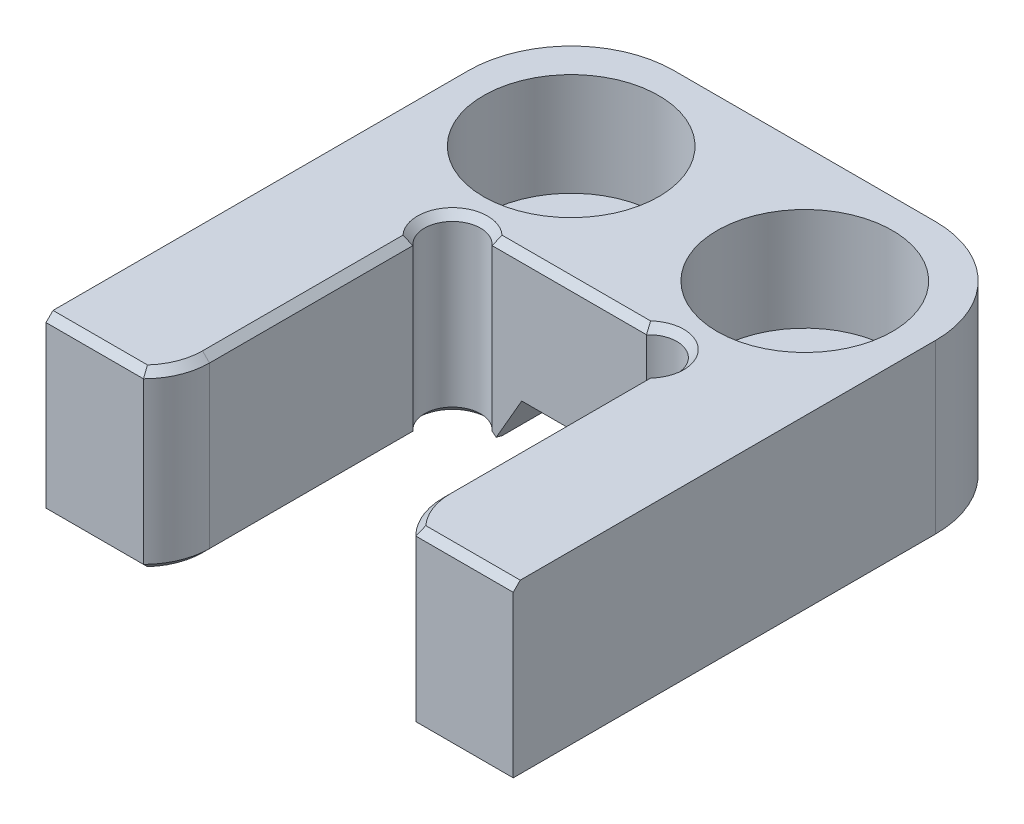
ISO-10303-21;
HEADER;
FILE_DESCRIPTION(('STEP AP214'),'2;1');
FILE_NAME('part.step','',(''),(''),'','','');
FILE_SCHEMA(('AUTOMOTIVE_DESIGN { 1 0 10303 214 1 1 1 1 }'));
ENDSEC;
DATA;
#1=APPLICATION_CONTEXT('core data for automotive mechanical design processes');
#2=APPLICATION_PROTOCOL_DEFINITION('international standard','automotive_design',2000,#1);
#3=PRODUCT_CONTEXT('',#1,'mechanical');
#4=PRODUCT('Part','Part','',(#3));
#5=PRODUCT_RELATED_PRODUCT_CATEGORY('part','',(#4));
#6=PRODUCT_DEFINITION_FORMATION('','',#4);
#7=PRODUCT_DEFINITION_CONTEXT('part definition',#1,'design');
#8=PRODUCT_DEFINITION('design','',#6,#7);
#9=PRODUCT_DEFINITION_SHAPE('','',#8);
#10=(LENGTH_UNIT() NAMED_UNIT(*) SI_UNIT(.MILLI.,.METRE.));
#11=(NAMED_UNIT(*) PLANE_ANGLE_UNIT() SI_UNIT($,.RADIAN.));
#12=(NAMED_UNIT(*) SI_UNIT($,.STERADIAN.) SOLID_ANGLE_UNIT());
#13=UNCERTAINTY_MEASURE_WITH_UNIT(LENGTH_MEASURE(1.E-05),#10,'distance_accuracy_value','');
#14=(GEOMETRIC_REPRESENTATION_CONTEXT(3) GLOBAL_UNCERTAINTY_ASSIGNED_CONTEXT((#13)) GLOBAL_UNIT_ASSIGNED_CONTEXT((#10,
#11,#12)) REPRESENTATION_CONTEXT('',''));
#15=CARTESIAN_POINT('',(0.,0.,0.));
#16=DIRECTION('',(0.,0.,1.));
#17=DIRECTION('',(1.,0.,0.));
#18=AXIS2_PLACEMENT_3D('',#15,#16,#17);
#19=CARTESIAN_POINT('',(-12.7,-9.4996,-28.5496));
#20=DIRECTION('',(0.,-1.,0.));
#21=DIRECTION('',(0.,0.,-1.));
#22=AXIS2_PLACEMENT_3D('',#19,#20,#21);
#23=PLANE('',#22);
#24=DIRECTION('',(0.,0.,1.));
#25=VECTOR('',#24,1.);
#26=CARTESIAN_POINT('',(4.09154355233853,-9.4996,-28.5496));
#27=LINE('',#26,#25);
#28=CARTESIAN_POINT('',(4.09154355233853,-9.4996,-21.0097883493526));
#29=VERTEX_POINT('',#28);
#30=CARTESIAN_POINT('',(4.09154355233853,-9.4996,-16.1760661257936));
#31=VERTEX_POINT('',#30);
#32=EDGE_CURVE('E279',#29,#31,#27,.T.);
#33=ORIENTED_EDGE('',*,*,#32,.F.);
#34=CARTESIAN_POINT('',(6.35,-9.4996,-22.1996));
#35=DIRECTION('',(0.,1.,0.));
#36=DIRECTION('',(0.,0.,1.));
#37=AXIS2_PLACEMENT_3D('',#34,#35,#36);
#38=CIRCLE('',#37,2.5527);
#39=CARTESIAN_POINT('',(4.09154355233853,-9.4996,-23.3894116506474));
#40=VERTEX_POINT('',#39);
#41=EDGE_CURVE('E54',#29,#40,#38,.T.);
#42=ORIENTED_EDGE('',*,*,#41,.T.);
#43=CARTESIAN_POINT('',(4.09154355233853,-9.4996,-28.1686));
#44=VERTEX_POINT('',#43);
#45=EDGE_CURVE('E275',#44,#40,#27,.T.);
#46=ORIENTED_EDGE('',*,*,#45,.F.);
#47=DIRECTION('',(1.,0.,0.));
#48=VECTOR('',#47,1.);
#49=CARTESIAN_POINT('',(-12.7,-9.4996,-28.1686));
#50=LINE('',#49,#48);
#51=CARTESIAN_POINT('',(7.112,-9.4996,-28.1686));
#52=VERTEX_POINT('',#51);
#53=EDGE_CURVE('E277',#44,#52,#50,.T.);
#54=ORIENTED_EDGE('',*,*,#53,.T.);
#55=CARTESIAN_POINT('',(7.112,-9.4996,-22.9616));
#56=DIRECTION('',(0.,-1.,0.));
#57=DIRECTION('',(0.,0.,-1.));
#58=AXIS2_PLACEMENT_3D('',#55,#56,#57);
#59=CIRCLE('',#58,5.207);
#60=CARTESIAN_POINT('',(12.319,-9.4996,-22.9616));
#61=VERTEX_POINT('',#60);
#62=EDGE_CURVE('E284',#52,#61,#59,.T.);
#63=ORIENTED_EDGE('',*,*,#62,.T.);
#64=DIRECTION('',(0.,0.,1.));
#65=VECTOR('',#64,1.);
#66=CARTESIAN_POINT('',(12.319,-9.4996,-28.5496));
#67=LINE('',#66,#65);
#68=CARTESIAN_POINT('',(12.319,-9.4996,-0.380999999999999));
#69=VERTEX_POINT('',#68);
#70=EDGE_CURVE('E286',#61,#69,#67,.T.);
#71=ORIENTED_EDGE('',*,*,#70,.T.);
#72=DIRECTION('',(-1.,0.,0.));
#73=VECTOR('',#72,1.);
#74=CARTESIAN_POINT('',(-12.7,-9.4996,-0.380999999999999));
#75=LINE('',#74,#73);
#76=CARTESIAN_POINT('',(7.56541160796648,-9.4996,-0.380999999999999));
#77=VERTEX_POINT('',#76);
#78=EDGE_CURVE('E288',#69,#77,#75,.T.);
#79=ORIENTED_EDGE('',*,*,#78,.T.);
#80=CARTESIAN_POINT('',(9.94136025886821,-9.4996,-2.54));
#81=DIRECTION('',(0.,-1.,0.));
#82=DIRECTION('',(0.,0.,-1.));
#83=AXIS2_PLACEMENT_3D('',#80,#81,#82);
#84=CIRCLE('',#83,3.21036025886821);
#85=CARTESIAN_POINT('',(6.731,-9.4996,-2.54));
#86=VERTEX_POINT('',#85);
#87=EDGE_CURVE('E290',#77,#86,#84,.T.);
#88=ORIENTED_EDGE('',*,*,#87,.T.);
#89=DIRECTION('',(0.,0.,-1.));
#90=VECTOR('',#89,1.);
#91=CARTESIAN_POINT('',(6.731,-9.4996,-28.5496));
#92=LINE('',#91,#90);
#93=CARTESIAN_POINT('',(6.731,-9.4996,-13.4368490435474));
#94=VERTEX_POINT('',#93);
#95=EDGE_CURVE('E292',#86,#94,#92,.T.);
#96=ORIENTED_EDGE('',*,*,#95,.T.);
#97=CARTESIAN_POINT('',(5.334,-9.4996,-14.732));
#98=DIRECTION('',(0.,-1.,0.));
#99=DIRECTION('',(0.,0.,-1.));
#100=AXIS2_PLACEMENT_3D('',#97,#98,#99);
#101=CIRCLE('',#100,1.905);
#102=EDGE_CURVE('E294',#94,#31,#101,.F.);
#103=ORIENTED_EDGE('',*,*,#102,.T.);
#104=EDGE_LOOP('',(#33,#42,#46,#54,#63,#71,#79,#88,#96,#103));
#105=FACE_BOUND('',#104,.T.);
#106=ADVANCED_FACE('F34',(#105),#23,.T.);
#107=CARTESIAN_POINT('',(-6.35,-9.4996,-22.1996));
#108=DIRECTION('',(0.,-1.,0.));
#109=DIRECTION('',(0.,0.,-1.));
#110=AXIS2_PLACEMENT_3D('',#107,#108,#109);
#111=CIRCLE('',#110,2.5527);
#112=CARTESIAN_POINT('',(-4.09154355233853,-9.4996,-21.0097883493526));
#113=VERTEX_POINT('',#112);
#114=CARTESIAN_POINT('',(-4.09154355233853,-9.4996,-23.3894116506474));
#115=VERTEX_POINT('',#114);
#116=EDGE_CURVE('E11',#113,#115,#111,.T.);
#117=ORIENTED_EDGE('',*,*,#116,.F.);
#118=DIRECTION('',(0.,0.,-1.));
#119=VECTOR('',#118,1.);
#120=CARTESIAN_POINT('',(-4.09154355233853,-9.4996,-28.5496));
#121=LINE('',#120,#119);
#122=CARTESIAN_POINT('',(-4.09154355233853,-9.4996,-16.1760661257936));
#123=VERTEX_POINT('',#122);
#124=EDGE_CURVE('E267',#123,#113,#121,.T.);
#125=ORIENTED_EDGE('',*,*,#124,.F.);
#126=CARTESIAN_POINT('',(-5.334,-9.4996,-14.732));
#127=DIRECTION('',(0.,-1.,0.));
#128=DIRECTION('',(0.,0.,-1.));
#129=AXIS2_PLACEMENT_3D('',#126,#127,#128);
#130=CIRCLE('',#129,1.905);
#131=CARTESIAN_POINT('',(-6.731,-9.4996,-13.4368490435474));
#132=VERTEX_POINT('',#131);
#133=EDGE_CURVE('E873',#123,#132,#130,.F.);
#134=ORIENTED_EDGE('',*,*,#133,.T.);
#135=DIRECTION('',(0.,0.,1.));
#136=VECTOR('',#135,1.);
#137=CARTESIAN_POINT('',(-6.731,-9.4996,-28.5496));
#138=LINE('',#137,#136);
#139=CARTESIAN_POINT('',(-6.731,-9.4996,-2.54));
#140=VERTEX_POINT('',#139);
#141=EDGE_CURVE('E870',#132,#140,#138,.T.);
#142=ORIENTED_EDGE('',*,*,#141,.T.);
#143=CARTESIAN_POINT('',(-9.94136025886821,-9.4996,-2.54));
#144=DIRECTION('',(0.,-1.,0.));
#145=DIRECTION('',(0.,0.,-1.));
#146=AXIS2_PLACEMENT_3D('',#143,#144,#145);
#147=CIRCLE('',#146,3.21036025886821);
#148=CARTESIAN_POINT('',(-7.56541160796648,-9.4996,-0.380999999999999));
#149=VERTEX_POINT('',#148);
#150=EDGE_CURVE('E871',#140,#149,#147,.T.);
#151=ORIENTED_EDGE('',*,*,#150,.T.);
#152=DIRECTION('',(-1.,0.,0.));
#153=VECTOR('',#152,1.);
#154=CARTESIAN_POINT('',(-12.7,-9.4996,-0.380999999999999));
#155=LINE('',#154,#153);
#156=CARTESIAN_POINT('',(-12.319,-9.4996,-0.380999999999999));
#157=VERTEX_POINT('',#156);
#158=EDGE_CURVE('E699',#149,#157,#155,.T.);
#159=ORIENTED_EDGE('',*,*,#158,.T.);
#160=DIRECTION('',(0.,0.,-1.));
#161=VECTOR('',#160,1.);
#162=CARTESIAN_POINT('',(-12.319,-9.4996,-28.5496));
#163=LINE('',#162,#161);
#164=CARTESIAN_POINT('',(-12.319,-9.4996,-22.9616));
#165=VERTEX_POINT('',#164);
#166=EDGE_CURVE('E717',#157,#165,#163,.T.);
#167=ORIENTED_EDGE('',*,*,#166,.T.);
#168=CARTESIAN_POINT('',(-7.112,-9.4996,-22.9616));
#169=DIRECTION('',(0.,-1.,0.));
#170=DIRECTION('',(0.,0.,-1.));
#171=AXIS2_PLACEMENT_3D('',#168,#169,#170);
#172=CIRCLE('',#171,5.207);
#173=CARTESIAN_POINT('',(-7.112,-9.4996,-28.1686));
#174=VERTEX_POINT('',#173);
#175=EDGE_CURVE('E878',#165,#174,#172,.T.);
#176=ORIENTED_EDGE('',*,*,#175,.T.);
#177=DIRECTION('',(1.,0.,0.));
#178=VECTOR('',#177,1.);
#179=CARTESIAN_POINT('',(-12.7,-9.4996,-28.1686));
#180=LINE('',#179,#178);
#181=CARTESIAN_POINT('',(-4.09154355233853,-9.4996,-28.1686));
#182=VERTEX_POINT('',#181);
#183=EDGE_CURVE('E273',#174,#182,#180,.T.);
#184=ORIENTED_EDGE('',*,*,#183,.T.);
#185=EDGE_CURVE('E265',#115,#182,#121,.T.);
#186=ORIENTED_EDGE('',*,*,#185,.F.);
#187=EDGE_LOOP('',(#117,#125,#134,#142,#151,#159,#167,#176,#184,#186));
#188=FACE_BOUND('',#187,.T.);
#189=ADVANCED_FACE('F271',(#188),#23,.T.);
#190=CARTESIAN_POINT('',(-12.7,-9.4996,0.));
#191=DIRECTION('',(-1.,0.,0.));
#192=DIRECTION('',(0.,0.,1.));
#193=AXIS2_PLACEMENT_3D('',#190,#191,#192);
#194=PLANE('',#193);
#195=DIRECTION('',(0.,1.,0.));
#196=VECTOR('',#195,1.);
#197=CARTESIAN_POINT('',(-12.7,-9.4996,-22.9616));
#198=LINE('',#197,#196);
#199=CARTESIAN_POINT('',(-12.7,0.,-22.9616));
#200=VERTEX_POINT('',#199);
#201=CARTESIAN_POINT('',(-12.7,-9.1186,-22.9616));
#202=VERTEX_POINT('',#201);
#203=EDGE_CURVE('E563',#200,#202,#198,.F.);
#204=ORIENTED_EDGE('',*,*,#203,.T.);
#205=DIRECTION('',(0.,0.,1.));
#206=VECTOR('',#205,1.);
#207=CARTESIAN_POINT('',(-12.7,-9.1186,0.));
#208=LINE('',#207,#206);
#209=CARTESIAN_POINT('',(-12.7,-9.1186,0.));
#210=VERTEX_POINT('',#209);
#211=EDGE_CURVE('E716',#202,#210,#208,.T.);
#212=ORIENTED_EDGE('',*,*,#211,.T.);
#213=DIRECTION('',(0.,1.,0.));
#214=VECTOR('',#213,1.);
#215=CARTESIAN_POINT('',(-12.7,-9.4996,0.));
#216=LINE('',#215,#214);
#217=CARTESIAN_POINT('',(-12.7,-0.381,0.));
#218=VERTEX_POINT('',#217);
#219=EDGE_CURVE('E546',#210,#218,#216,.T.);
#220=ORIENTED_EDGE('',*,*,#219,.T.);
#221=DIRECTION('',(0.,0.707106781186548,-0.707106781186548));
#222=VECTOR('',#221,1.);
#223=CARTESIAN_POINT('',(-12.7,-4.9403,4.5593));
#224=LINE('',#223,#222);
#225=CARTESIAN_POINT('',(-12.7,0.,-0.381000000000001));
#226=VERTEX_POINT('',#225);
#227=EDGE_CURVE('E858',#218,#226,#224,.T.);
#228=ORIENTED_EDGE('',*,*,#227,.T.);
#229=DIRECTION('',(0.,0.,1.));
#230=VECTOR('',#229,1.);
#231=CARTESIAN_POINT('',(-12.7,0.,0.));
#232=LINE('',#231,#230);
#233=EDGE_CURVE('E530',#200,#226,#232,.T.);
#234=ORIENTED_EDGE('',*,*,#233,.F.);
#235=EDGE_LOOP('',(#204,#212,#220,#228,#234));
#236=FACE_BOUND('',#235,.T.);
#237=ADVANCED_FACE('F391',(#236),#194,.T.);
#238=CARTESIAN_POINT('',(-12.7,-9.4996,-28.5496));
#239=DIRECTION('',(0.,0.,-1.));
#240=DIRECTION('',(-1.,0.,0.));
#241=AXIS2_PLACEMENT_3D('',#238,#239,#240);
#242=PLANE('',#241);
#243=DIRECTION('',(0.,1.,0.));
#244=VECTOR('',#243,1.);
#245=CARTESIAN_POINT('',(7.112,-9.4996,-28.5496));
#246=LINE('',#245,#244);
#247=CARTESIAN_POINT('',(7.112,0.,-28.5496));
#248=VERTEX_POINT('',#247);
#249=CARTESIAN_POINT('',(7.112,-9.1186,-28.5496));
#250=VERTEX_POINT('',#249);
#251=EDGE_CURVE('E561',#248,#250,#246,.F.);
#252=ORIENTED_EDGE('',*,*,#251,.T.);
#253=DIRECTION('',(-1.,0.,0.));
#254=VECTOR('',#253,1.);
#255=CARTESIAN_POINT('',(-12.7,-9.1186,-28.5496));
#256=LINE('',#255,#254);
#257=CARTESIAN_POINT('',(4.31151400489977,-9.1186,-28.5496));
#258=VERTEX_POINT('',#257);
#259=EDGE_CURVE('E612',#250,#258,#256,.T.);
#260=ORIENTED_EDGE('',*,*,#259,.T.);
#261=DIRECTION('',(-0.499999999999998,0.86602540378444,0.));
#262=VECTOR('',#261,1.);
#263=CARTESIAN_POINT('',(3.50495567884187,-7.7216,-28.5496));
#264=LINE('',#263,#262);
#265=CARTESIAN_POINT('',(3.39497045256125,-7.5311,-28.5496));
#266=VERTEX_POINT('',#265);
#267=EDGE_CURVE('E611',#258,#266,#264,.T.);
#268=ORIENTED_EDGE('',*,*,#267,.T.);
#269=DIRECTION('',(-1.,0.,0.));
#270=VECTOR('',#269,1.);
#271=CARTESIAN_POINT('',(-3.175,-7.5311,-28.5496));
#272=LINE('',#271,#270);
#273=CARTESIAN_POINT('',(-3.39497045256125,-7.5311,-28.5496));
#274=VERTEX_POINT('',#273);
#275=EDGE_CURVE('E609',#266,#274,#272,.T.);
#276=ORIENTED_EDGE('',*,*,#275,.T.);
#277=DIRECTION('',(-0.499999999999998,-0.86602540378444,0.));
#278=VECTOR('',#277,1.);
#279=CARTESIAN_POINT('',(-4.4214992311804,-9.3091,-28.5496));
#280=LINE('',#279,#278);
#281=CARTESIAN_POINT('',(-4.31151400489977,-9.1186,-28.5496));
#282=VERTEX_POINT('',#281);
#283=EDGE_CURVE('E607',#274,#282,#280,.T.);
#284=ORIENTED_EDGE('',*,*,#283,.T.);
#285=DIRECTION('',(-1.,0.,0.));
#286=VECTOR('',#285,1.);
#287=CARTESIAN_POINT('',(-12.7,-9.1186,-28.5496));
#288=LINE('',#287,#286);
#289=CARTESIAN_POINT('',(-7.112,-9.1186,-28.5496));
#290=VERTEX_POINT('',#289);
#291=EDGE_CURVE('E605',#282,#290,#288,.T.);
#292=ORIENTED_EDGE('',*,*,#291,.T.);
#293=DIRECTION('',(0.,1.,0.));
#294=VECTOR('',#293,1.);
#295=CARTESIAN_POINT('',(-7.112,-9.4996,-28.5496));
#296=LINE('',#295,#294);
#297=CARTESIAN_POINT('',(-7.112,0.,-28.5496));
#298=VERTEX_POINT('',#297);
#299=EDGE_CURVE('E559',#290,#298,#296,.T.);
#300=ORIENTED_EDGE('',*,*,#299,.T.);
#301=DIRECTION('',(-1.,0.,0.));
#302=VECTOR('',#301,1.);
#303=CARTESIAN_POINT('',(-12.7,0.,-28.5496));
#304=LINE('',#303,#302);
#305=EDGE_CURVE('E543',#248,#298,#304,.T.);
#306=ORIENTED_EDGE('',*,*,#305,.F.);
#307=EDGE_LOOP('',(#252,#260,#268,#276,#284,#292,#300,#306));
#308=FACE_BOUND('',#307,.T.);
#309=ADVANCED_FACE('F394',(#308),#242,.T.);
#310=CARTESIAN_POINT('',(12.7,-9.4996,0.));
#311=DIRECTION('',(1.,0.,0.));
#312=DIRECTION('',(0.,0.,-1.));
#313=AXIS2_PLACEMENT_3D('',#310,#311,#312);
#314=PLANE('',#313);
#315=DIRECTION('',(0.,1.,0.));
#316=VECTOR('',#315,1.);
#317=CARTESIAN_POINT('',(12.7,-9.4996,0.));
#318=LINE('',#317,#316);
#319=CARTESIAN_POINT('',(12.7,-9.1186,0.));
#320=VERTEX_POINT('',#319);
#321=CARTESIAN_POINT('',(12.7,-0.380999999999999,0.));
#322=VERTEX_POINT('',#321);
#323=EDGE_CURVE('E547',#320,#322,#318,.T.);
#324=ORIENTED_EDGE('',*,*,#323,.F.);
#325=DIRECTION('',(0.,0.,-1.));
#326=VECTOR('',#325,1.);
#327=CARTESIAN_POINT('',(12.7,-9.1186,0.));
#328=LINE('',#327,#326);
#329=CARTESIAN_POINT('',(12.7,-9.1186,-22.9616));
#330=VERTEX_POINT('',#329);
#331=EDGE_CURVE('E601',#320,#330,#328,.T.);
#332=ORIENTED_EDGE('',*,*,#331,.T.);
#333=DIRECTION('',(0.,1.,0.));
#334=VECTOR('',#333,1.);
#335=CARTESIAN_POINT('',(12.7,-9.4996,-22.9616));
#336=LINE('',#335,#334);
#337=CARTESIAN_POINT('',(12.7,0.,-22.9616));
#338=VERTEX_POINT('',#337);
#339=EDGE_CURVE('E550',#330,#338,#336,.T.);
#340=ORIENTED_EDGE('',*,*,#339,.T.);
#341=DIRECTION('',(0.,0.,-1.));
#342=VECTOR('',#341,1.);
#343=CARTESIAN_POINT('',(12.7,0.,0.));
#344=LINE('',#343,#342);
#345=CARTESIAN_POINT('',(12.7,0.,-0.381000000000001));
#346=VERTEX_POINT('',#345);
#347=EDGE_CURVE('E541',#346,#338,#344,.T.);
#348=ORIENTED_EDGE('',*,*,#347,.F.);
#349=DIRECTION('',(0.,-0.707106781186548,0.707106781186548));
#350=VECTOR('',#349,1.);
#351=CARTESIAN_POINT('',(12.7,-4.9403,4.5593));
#352=LINE('',#351,#350);
#353=EDGE_CURVE('E599',#346,#322,#352,.T.);
#354=ORIENTED_EDGE('',*,*,#353,.T.);
#355=EDGE_LOOP('',(#324,#332,#340,#348,#354));
#356=FACE_BOUND('',#355,.T.);
#357=ADVANCED_FACE('F822',(#356),#314,.T.);
#358=CARTESIAN_POINT('',(6.35,-9.4996,0.));
#359=DIRECTION('',(0.,0.,1.));
#360=DIRECTION('',(1.,0.,0.));
#361=AXIS2_PLACEMENT_3D('',#358,#359,#360);
#362=PLANE('',#361);
#363=DIRECTION('',(0.,1.,0.));
#364=VECTOR('',#363,1.);
#365=CARTESIAN_POINT('',(7.40240998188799,-9.4996,0.));
#366=LINE('',#365,#364);
#367=CARTESIAN_POINT('',(7.40240998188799,-9.1186,0.));
#368=VERTEX_POINT('',#367);
#369=CARTESIAN_POINT('',(7.40240998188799,-0.380999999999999,0.));
#370=VERTEX_POINT('',#369);
#371=EDGE_CURVE('E534',#368,#370,#366,.T.);
#372=ORIENTED_EDGE('',*,*,#371,.F.);
#373=DIRECTION('',(1.,0.,0.));
#374=VECTOR('',#373,1.);
#375=CARTESIAN_POINT('',(6.35,-9.1186,0.));
#376=LINE('',#375,#374);
#377=EDGE_CURVE('E597',#368,#320,#376,.T.);
#378=ORIENTED_EDGE('',*,*,#377,.T.);
#379=ORIENTED_EDGE('',*,*,#323,.T.);
#380=DIRECTION('',(-1.,0.,0.));
#381=VECTOR('',#380,1.);
#382=CARTESIAN_POINT('',(7.40240998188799,-0.380999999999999,0.));
#383=LINE('',#382,#381);
#384=EDGE_CURVE('E595',#322,#370,#383,.T.);
#385=ORIENTED_EDGE('',*,*,#384,.T.);
#386=EDGE_LOOP('',(#372,#378,#379,#385));
#387=FACE_BOUND('',#386,.T.);
#388=ADVANCED_FACE('F824',(#387),#362,.T.);
#389=CARTESIAN_POINT('',(6.35,-9.4996,0.));
#390=DIRECTION('',(-1.,0.,0.));
#391=DIRECTION('',(0.,0.,1.));
#392=AXIS2_PLACEMENT_3D('',#389,#390,#391);
#393=PLANE('',#392);
#394=DIRECTION('',(0.,1.,0.));
#395=VECTOR('',#394,1.);
#396=CARTESIAN_POINT('',(6.35,-9.4996,-13.5960774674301));
#397=LINE('',#396,#395);
#398=CARTESIAN_POINT('',(6.35,-9.1186,-13.5960774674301));
#399=VERTEX_POINT('',#398);
#400=CARTESIAN_POINT('',(6.35,-0.380999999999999,-13.5960774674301));
#401=VERTEX_POINT('',#400);
#402=EDGE_CURVE('E517',#399,#401,#397,.T.);
#403=ORIENTED_EDGE('',*,*,#402,.F.);
#404=DIRECTION('',(0.,0.,1.));
#405=VECTOR('',#404,1.);
#406=CARTESIAN_POINT('',(6.35,-9.1186,0.));
#407=LINE('',#406,#405);
#408=CARTESIAN_POINT('',(6.35,-9.1186,-2.54));
#409=VERTEX_POINT('',#408);
#410=EDGE_CURVE('E581',#399,#409,#407,.T.);
#411=ORIENTED_EDGE('',*,*,#410,.T.);
#412=DIRECTION('',(0.,1.,0.));
#413=VECTOR('',#412,1.);
#414=CARTESIAN_POINT('',(6.35,-9.4996,-2.54));
#415=LINE('',#414,#413);
#416=CARTESIAN_POINT('',(6.35,-0.380999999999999,-2.54));
#417=VERTEX_POINT('',#416);
#418=EDGE_CURVE('E531',#409,#417,#415,.T.);
#419=ORIENTED_EDGE('',*,*,#418,.T.);
#420=DIRECTION('',(0.,0.,-1.));
#421=VECTOR('',#420,1.);
#422=CARTESIAN_POINT('',(6.35,-0.380999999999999,-13.5960774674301));
#423=LINE('',#422,#421);
#424=EDGE_CURVE('E585',#417,#401,#423,.T.);
#425=ORIENTED_EDGE('',*,*,#424,.T.);
#426=EDGE_LOOP('',(#403,#411,#419,#425));
#427=FACE_BOUND('',#426,.T.);
#428=ADVANCED_FACE('F379',(#427),#393,.T.);
#429=CARTESIAN_POINT('',(-6.35,-9.4996,-15.748));
#430=DIRECTION('',(0.,0.,1.));
#431=DIRECTION('',(1.,0.,0.));
#432=AXIS2_PLACEMENT_3D('',#429,#430,#431);
#433=PLANE('',#432);
#434=DIRECTION('',(-0.499999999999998,-0.86602540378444,0.));
#435=VECTOR('',#434,1.);
#436=CARTESIAN_POINT('',(-4.65615766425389,-10.4775403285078,-15.748));
#437=LINE('',#436,#435);
#438=CARTESIAN_POINT('',(-2.58559094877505,-6.89121357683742,-15.748));
#439=VERTEX_POINT('',#438);
#440=CARTESIAN_POINT('',(-3.97249780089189,-9.29340671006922,-15.748));
#441=VERTEX_POINT('',#440);
#442=EDGE_CURVE('E511',#439,#441,#437,.T.);
#443=ORIENTED_EDGE('',*,*,#442,.F.);
#444=DIRECTION('',(1.,0.,0.));
#445=VECTOR('',#444,1.);
#446=CARTESIAN_POINT('',(3.175,-6.89121357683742,-15.748));
#447=LINE('',#446,#445);
#448=CARTESIAN_POINT('',(2.58559094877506,-6.89121357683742,-15.748));
#449=VERTEX_POINT('',#448);
#450=EDGE_CURVE('E677',#439,#449,#447,.T.);
#451=ORIENTED_EDGE('',*,*,#450,.T.);
#452=DIRECTION('',(-0.499999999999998,0.86602540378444,0.));
#453=VECTOR('',#452,1.);
#454=CARTESIAN_POINT('',(1.48115766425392,-4.97827901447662,-15.748));
#455=LINE('',#454,#453);
#456=CARTESIAN_POINT('',(3.9724978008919,-9.29340671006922,-15.748));
#457=VERTEX_POINT('',#456);
#458=EDGE_CURVE('E506',#457,#449,#455,.T.);
#459=ORIENTED_EDGE('',*,*,#458,.F.);
#460=CARTESIAN_POINT('',(3.9724978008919,-9.29340671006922,-15.748));
#461=CARTESIAN_POINT('',(3.99105697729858,-9.27853301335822,-15.748));
#462=CARTESIAN_POINT('',(4.00966888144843,-9.26372487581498,-15.748));
#463=CARTESIAN_POINT('',(4.04700729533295,-9.23425678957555,-15.748));
#464=CARTESIAN_POINT('',(4.06573379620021,-9.21959682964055,-15.748));
#465=CARTESIAN_POINT('',(4.10331361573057,-9.19043971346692,-15.748));
#466=CARTESIAN_POINT('',(4.12216693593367,-9.17594255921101,-15.748));
#467=CARTESIAN_POINT('',(4.16001406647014,-9.14712985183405,-15.748));
#468=CARTESIAN_POINT('',(4.17900788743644,-9.1328143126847,-15.748));
#469=CARTESIAN_POINT('',(4.19807746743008,-9.11859999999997,-15.748));
#470=B_SPLINE_CURVE_WITH_KNOTS('',3,(#460,#461,#462,#463,#464,#465,#466,#467,#468,#469),
.UNSPECIFIED.,.F.,.F.,(4,2,2,2,4),(0.,0.0713515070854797,0.142697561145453,0.21404448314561,
0.285396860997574),.UNSPECIFIED.);
#471=CARTESIAN_POINT('',(4.19807746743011,-9.1186,-15.748));
#472=VERTEX_POINT('',#471);
#473=EDGE_CURVE('E368',#457,#472,#470,.T.);
#474=ORIENTED_EDGE('',*,*,#473,.T.);
#475=DIRECTION('',(0.,1.,0.));
#476=VECTOR('',#475,1.);
#477=CARTESIAN_POINT('',(4.19807746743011,-9.4996,-15.748));
#478=LINE('',#477,#476);
#479=CARTESIAN_POINT('',(4.19807746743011,-0.380999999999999,-15.748));
#480=VERTEX_POINT('',#479);
#481=EDGE_CURVE('E514',#480,#472,#478,.F.);
#482=ORIENTED_EDGE('',*,*,#481,.F.);
#483=DIRECTION('',(-1.,0.,0.));
#484=VECTOR('',#483,1.);
#485=CARTESIAN_POINT('',(-4.1980774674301,-0.380999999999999,-15.748));
#486=LINE('',#485,#484);
#487=CARTESIAN_POINT('',(-4.1980774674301,-0.380999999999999,-15.748));
#488=VERTEX_POINT('',#487);
#489=EDGE_CURVE('E306',#480,#488,#486,.T.);
#490=ORIENTED_EDGE('',*,*,#489,.T.);
#491=DIRECTION('',(0.,1.,0.));
#492=VECTOR('',#491,1.);
#493=CARTESIAN_POINT('',(-4.1980774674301,-9.4996,-15.748));
#494=LINE('',#493,#492);
#495=CARTESIAN_POINT('',(-4.1980774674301,-9.1186,-15.748));
#496=VERTEX_POINT('',#495);
#497=EDGE_CURVE('E523',#496,#488,#494,.T.);
#498=ORIENTED_EDGE('',*,*,#497,.F.);
#499=CARTESIAN_POINT('',(-4.1980774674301,-9.1186,-15.748));
#500=CARTESIAN_POINT('',(-4.17900788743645,-9.13281431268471,-15.748));
#501=CARTESIAN_POINT('',(-4.16001406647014,-9.14712985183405,-15.748));
#502=CARTESIAN_POINT('',(-4.12216693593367,-9.175942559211,-15.748));
#503=CARTESIAN_POINT('',(-4.10331361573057,-9.19043971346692,-15.748));
#504=CARTESIAN_POINT('',(-4.06573379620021,-9.21959682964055,-15.748));
#505=CARTESIAN_POINT('',(-4.04700729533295,-9.23425678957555,-15.748));
#506=CARTESIAN_POINT('',(-4.00966888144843,-9.26372487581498,-15.748));
#507=CARTESIAN_POINT('',(-3.99105697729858,-9.27853301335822,-15.748));
#508=CARTESIAN_POINT('',(-3.97249780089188,-9.2934067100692,-15.748));
#509=B_SPLINE_CURVE_WITH_KNOTS('',3,(#499,#500,#501,#502,#503,#504,#505,#506,#507,#508),
.UNSPECIFIED.,.F.,.F.,(4,2,2,2,4),(0.,0.0713523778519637,0.14269929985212,0.214045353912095,
0.285396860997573),.UNSPECIFIED.);
#510=EDGE_CURVE('E362',#496,#441,#509,.T.);
#511=ORIENTED_EDGE('',*,*,#510,.T.);
#512=EDGE_LOOP('',(#443,#451,#459,#474,#482,#490,#498,#511));
#513=FACE_BOUND('',#512,.T.);
#514=ADVANCED_FACE('F373',(#513),#433,.T.);
#515=CARTESIAN_POINT('',(-6.35,-9.4996,0.));
#516=DIRECTION('',(1.,0.,0.));
#517=DIRECTION('',(0.,0.,-1.));
#518=AXIS2_PLACEMENT_3D('',#515,#516,#517);
#519=PLANE('',#518);
#520=DIRECTION('',(0.,1.,0.));
#521=VECTOR('',#520,1.);
#522=CARTESIAN_POINT('',(-6.35,-9.4996,-2.54));
#523=LINE('',#522,#521);
#524=CARTESIAN_POINT('',(-6.35,-9.1186,-2.54));
#525=VERTEX_POINT('',#524);
#526=CARTESIAN_POINT('',(-6.35,-0.380999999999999,-2.54));
#527=VERTEX_POINT('',#526);
#528=EDGE_CURVE('E527',#525,#527,#523,.T.);
#529=ORIENTED_EDGE('',*,*,#528,.F.);
#530=DIRECTION('',(0.,0.,-1.));
#531=VECTOR('',#530,1.);
#532=CARTESIAN_POINT('',(-6.35,-9.1186,0.));
#533=LINE('',#532,#531);
#534=CARTESIAN_POINT('',(-6.35,-9.1186,-13.5960774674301));
#535=VERTEX_POINT('',#534);
#536=EDGE_CURVE('E863',#525,#535,#533,.T.);
#537=ORIENTED_EDGE('',*,*,#536,.T.);
#538=DIRECTION('',(0.,1.,0.));
#539=VECTOR('',#538,1.);
#540=CARTESIAN_POINT('',(-6.35,-9.4996,-13.5960774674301));
#541=LINE('',#540,#539);
#542=CARTESIAN_POINT('',(-6.35,-0.380999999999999,-13.5960774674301));
#543=VERTEX_POINT('',#542);
#544=EDGE_CURVE('E520',#543,#535,#541,.F.);
#545=ORIENTED_EDGE('',*,*,#544,.F.);
#546=DIRECTION('',(0.,0.,1.));
#547=VECTOR('',#546,1.);
#548=CARTESIAN_POINT('',(-6.35,-0.380999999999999,-2.54));
#549=LINE('',#548,#547);
#550=EDGE_CURVE('E856',#543,#527,#549,.T.);
#551=ORIENTED_EDGE('',*,*,#550,.T.);
#552=EDGE_LOOP('',(#529,#537,#545,#551));
#553=FACE_BOUND('',#552,.T.);
#554=ADVANCED_FACE('F378',(#553),#519,.T.);
#555=CARTESIAN_POINT('',(-12.7,-9.4996,0.));
#556=DIRECTION('',(0.,0.,1.));
#557=DIRECTION('',(1.,0.,0.));
#558=AXIS2_PLACEMENT_3D('',#555,#556,#557);
#559=PLANE('',#558);
#560=ORIENTED_EDGE('',*,*,#219,.F.);
#561=DIRECTION('',(1.,0.,0.));
#562=VECTOR('',#561,1.);
#563=CARTESIAN_POINT('',(-12.7,-9.1186,0.));
#564=LINE('',#563,#562);
#565=CARTESIAN_POINT('',(-7.40240998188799,-9.1186,0.));
#566=VERTEX_POINT('',#565);
#567=EDGE_CURVE('E720',#210,#566,#564,.T.);
#568=ORIENTED_EDGE('',*,*,#567,.T.);
#569=DIRECTION('',(0.,1.,0.));
#570=VECTOR('',#569,1.);
#571=CARTESIAN_POINT('',(-7.40240998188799,-9.4996,0.));
#572=LINE('',#571,#570);
#573=CARTESIAN_POINT('',(-7.40240998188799,-0.380999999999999,0.));
#574=VERTEX_POINT('',#573);
#575=EDGE_CURVE('E526',#566,#574,#572,.T.);
#576=ORIENTED_EDGE('',*,*,#575,.T.);
#577=DIRECTION('',(-1.,0.,0.));
#578=VECTOR('',#577,1.);
#579=CARTESIAN_POINT('',(-12.7,-0.380999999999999,0.));
#580=LINE('',#579,#578);
#581=EDGE_CURVE('E725',#574,#218,#580,.T.);
#582=ORIENTED_EDGE('',*,*,#581,.T.);
#583=EDGE_LOOP('',(#560,#568,#576,#582));
#584=FACE_BOUND('',#583,.T.);
#585=ADVANCED_FACE('F385',(#584),#559,.T.);
#586=CARTESIAN_POINT('',(-12.7,0.,-28.5496));
#587=DIRECTION('',(0.,-1.,0.));
#588=DIRECTION('',(0.,0.,-1.));
#589=AXIS2_PLACEMENT_3D('',#586,#587,#588);
#590=PLANE('',#589);
#591=CARTESIAN_POINT('',(-6.35,0.,-22.1996));
#592=DIRECTION('',(0.,1.,0.));
#593=DIRECTION('',(0.,0.,1.));
#594=AXIS2_PLACEMENT_3D('',#591,#592,#593);
#595=CIRCLE('',#594,4.7625);
#596=CARTESIAN_POINT('',(-6.35,0.,-17.4371));
#597=VERTEX_POINT('',#596);
#598=EDGE_CURVE('E650',#597,#597,#595,.T.);
#599=ORIENTED_EDGE('',*,*,#598,.F.);
#600=EDGE_LOOP('',(#599));
#601=FACE_BOUND('',#600,.T.);
#602=CARTESIAN_POINT('',(6.35,0.,-22.1996));
#603=DIRECTION('',(0.,1.,0.));
#604=DIRECTION('',(0.,0.,1.));
#605=AXIS2_PLACEMENT_3D('',#602,#603,#604);
#606=CIRCLE('',#605,4.7625);
#607=CARTESIAN_POINT('',(6.35,0.,-17.4371));
#608=VERTEX_POINT('',#607);
#609=EDGE_CURVE('E268',#608,#608,#606,.T.);
#610=ORIENTED_EDGE('',*,*,#609,.F.);
#611=EDGE_LOOP('',(#610));
#612=FACE_BOUND('',#611,.T.);
#613=CARTESIAN_POINT('',(9.94136025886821,0.,-2.54));
#614=DIRECTION('',(0.,-1.,0.));
#615=DIRECTION('',(0.,0.,-1.));
#616=AXIS2_PLACEMENT_3D('',#613,#614,#615);
#617=CIRCLE('',#616,3.21036025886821);
#618=CARTESIAN_POINT('',(6.731,0.,-2.54));
#619=VERTEX_POINT('',#618);
#620=CARTESIAN_POINT('',(7.56541160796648,0.,-0.381000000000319));
#621=VERTEX_POINT('',#620);
#622=EDGE_CURVE('E663',#619,#621,#617,.F.);
#623=ORIENTED_EDGE('',*,*,#622,.T.);
#624=DIRECTION('',(1.,0.,0.));
#625=VECTOR('',#624,1.);
#626=CARTESIAN_POINT('',(12.7,0.,-0.380999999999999));
#627=LINE('',#626,#625);
#628=EDGE_CURVE('E419',#621,#346,#627,.T.);
#629=ORIENTED_EDGE('',*,*,#628,.T.);
#630=ORIENTED_EDGE('',*,*,#347,.T.);
#631=CARTESIAN_POINT('',(7.112,0.,-22.9616));
#632=DIRECTION('',(0.,-1.,0.));
#633=DIRECTION('',(0.,0.,-1.));
#634=AXIS2_PLACEMENT_3D('',#631,#632,#633);
#635=CIRCLE('',#634,5.588);
#636=EDGE_CURVE('E557',#338,#248,#635,.F.);
#637=ORIENTED_EDGE('',*,*,#636,.T.);
#638=ORIENTED_EDGE('',*,*,#305,.T.);
#639=CARTESIAN_POINT('',(-7.112,0.,-22.9616));
#640=DIRECTION('',(0.,-1.,0.));
#641=DIRECTION('',(0.,0.,-1.));
#642=AXIS2_PLACEMENT_3D('',#639,#640,#641);
#643=CIRCLE('',#642,5.588);
#644=EDGE_CURVE('E555',#298,#200,#643,.F.);
#645=ORIENTED_EDGE('',*,*,#644,.T.);
#646=ORIENTED_EDGE('',*,*,#233,.T.);
#647=DIRECTION('',(1.,0.,0.));
#648=VECTOR('',#647,1.);
#649=CARTESIAN_POINT('',(-7.40240998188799,0.,-0.380999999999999));
#650=LINE('',#649,#648);
#651=CARTESIAN_POINT('',(-7.56541160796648,0.,-0.380999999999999));
#652=VERTEX_POINT('',#651);
#653=EDGE_CURVE('E724',#226,#652,#650,.T.);
#654=ORIENTED_EDGE('',*,*,#653,.T.);
#655=CARTESIAN_POINT('',(-9.94136025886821,0.,-2.54));
#656=DIRECTION('',(0.,-1.,0.));
#657=DIRECTION('',(0.,0.,-1.));
#658=AXIS2_PLACEMENT_3D('',#655,#656,#657);
#659=CIRCLE('',#658,3.21036025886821);
#660=CARTESIAN_POINT('',(-6.731,0.,-2.54));
#661=VERTEX_POINT('',#660);
#662=EDGE_CURVE('E727',#652,#661,#659,.F.);
#663=ORIENTED_EDGE('',*,*,#662,.T.);
#664=DIRECTION('',(0.,0.,-1.));
#665=VECTOR('',#664,1.);
#666=CARTESIAN_POINT('',(-6.731,0.,-13.5960774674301));
#667=LINE('',#666,#665);
#668=CARTESIAN_POINT('',(-6.731,0.,-13.4368490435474));
#669=VERTEX_POINT('',#668);
#670=EDGE_CURVE('E734',#661,#669,#667,.T.);
#671=ORIENTED_EDGE('',*,*,#670,.T.);
#672=CARTESIAN_POINT('',(-5.334,0.,-14.732));
#673=DIRECTION('',(0.,-1.,0.));
#674=DIRECTION('',(0.,0.,-1.));
#675=AXIS2_PLACEMENT_3D('',#672,#673,#674);
#676=CIRCLE('',#675,1.905);
#677=CARTESIAN_POINT('',(-4.03884904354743,0.,-16.129));
#678=VERTEX_POINT('',#677);
#679=EDGE_CURVE('E736',#669,#678,#676,.T.);
#680=ORIENTED_EDGE('',*,*,#679,.T.);
#681=DIRECTION('',(1.,0.,0.));
#682=VECTOR('',#681,1.);
#683=CARTESIAN_POINT('',(4.19807746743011,0.,-16.129));
#684=LINE('',#683,#682);
#685=CARTESIAN_POINT('',(4.03884904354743,0.,-16.129));
#686=VERTEX_POINT('',#685);
#687=EDGE_CURVE('E738',#678,#686,#684,.T.);
#688=ORIENTED_EDGE('',*,*,#687,.T.);
#689=CARTESIAN_POINT('',(5.334,0.,-14.732));
#690=DIRECTION('',(0.,-1.,0.));
#691=DIRECTION('',(0.,0.,-1.));
#692=AXIS2_PLACEMENT_3D('',#689,#690,#691);
#693=CIRCLE('',#692,1.905);
#694=CARTESIAN_POINT('',(6.731,0.,-13.4368490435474));
#695=VERTEX_POINT('',#694);
#696=EDGE_CURVE('E740',#686,#695,#693,.T.);
#697=ORIENTED_EDGE('',*,*,#696,.T.);
#698=DIRECTION('',(0.,0.,1.));
#699=VECTOR('',#698,1.);
#700=CARTESIAN_POINT('',(6.731,0.,-2.54));
#701=LINE('',#700,#699);
#702=EDGE_CURVE('E668',#695,#619,#701,.T.);
#703=ORIENTED_EDGE('',*,*,#702,.T.);
#704=EDGE_LOOP('',(#623,#629,#630,#637,#638,#645,#646,#654,#663,#671,#680,#688,#697,#703));
#705=FACE_BOUND('',#704,.T.);
#706=ADVANCED_FACE('F389',(#601,#612,#705),#590,.F.);
#707=CARTESIAN_POINT('',(7.112,-9.4996,-22.9616));
#708=DIRECTION('',(0.,1.,0.));
#709=DIRECTION('',(0.,0.,1.));
#710=AXIS2_PLACEMENT_3D('',#707,#708,#709);
#711=CYLINDRICAL_SURFACE('',#710,5.588);
#712=ORIENTED_EDGE('',*,*,#339,.F.);
#713=CARTESIAN_POINT('',(7.112,-9.1186,-22.9616));
#714=DIRECTION('',(0.,-1.,0.));
#715=DIRECTION('',(0.,0.,-1.));
#716=AXIS2_PLACEMENT_3D('',#713,#714,#715);
#717=CIRCLE('',#716,5.588);
#718=EDGE_CURVE('E603',#330,#250,#717,.F.);
#719=ORIENTED_EDGE('',*,*,#718,.T.);
#720=ORIENTED_EDGE('',*,*,#251,.F.);
#721=ORIENTED_EDGE('',*,*,#636,.F.);
#722=EDGE_LOOP('',(#712,#719,#720,#721));
#723=FACE_BOUND('',#722,.T.);
#724=ADVANCED_FACE('F396',(#723),#711,.T.);
#725=CARTESIAN_POINT('',(-7.112,-9.4996,-22.9616));
#726=DIRECTION('',(0.,1.,0.));
#727=DIRECTION('',(0.,0.,1.));
#728=AXIS2_PLACEMENT_3D('',#725,#726,#727);
#729=CYLINDRICAL_SURFACE('',#728,5.588);
#730=ORIENTED_EDGE('',*,*,#299,.F.);
#731=CARTESIAN_POINT('',(-7.112,-9.1186,-22.9616));
#732=DIRECTION('',(0.,-1.,0.));
#733=DIRECTION('',(0.,0.,-1.));
#734=AXIS2_PLACEMENT_3D('',#731,#732,#733);
#735=CIRCLE('',#734,5.588);
#736=EDGE_CURVE('E881',#290,#202,#735,.F.);
#737=ORIENTED_EDGE('',*,*,#736,.T.);
#738=ORIENTED_EDGE('',*,*,#203,.F.);
#739=ORIENTED_EDGE('',*,*,#644,.F.);
#740=EDGE_LOOP('',(#730,#737,#738,#739));
#741=FACE_BOUND('',#740,.T.);
#742=ADVANCED_FACE('F399',(#741),#729,.T.);
#743=CARTESIAN_POINT('',(9.94136025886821,-9.4996,-2.54));
#744=DIRECTION('',(0.,1.,0.));
#745=DIRECTION('',(0.,0.,1.));
#746=AXIS2_PLACEMENT_3D('',#743,#744,#745);
#747=CYLINDRICAL_SURFACE('',#746,3.59136025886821);
#748=ORIENTED_EDGE('',*,*,#418,.F.);
#749=CARTESIAN_POINT('',(9.94136025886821,-9.1186,-2.54));
#750=DIRECTION('',(0.,-1.,0.));
#751=DIRECTION('',(0.,0.,-1.));
#752=AXIS2_PLACEMENT_3D('',#749,#750,#751);
#753=CIRCLE('',#752,3.59136025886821);
#754=EDGE_CURVE('E593',#409,#368,#753,.F.);
#755=ORIENTED_EDGE('',*,*,#754,.T.);
#756=ORIENTED_EDGE('',*,*,#371,.T.);
#757=CARTESIAN_POINT('',(9.94136025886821,-0.380999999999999,-2.54));
#758=DIRECTION('',(0.,-1.,0.));
#759=DIRECTION('',(0.,0.,-1.));
#760=AXIS2_PLACEMENT_3D('',#757,#758,#759);
#761=CIRCLE('',#760,3.59136025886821);
#762=EDGE_CURVE('E591',#370,#417,#761,.T.);
#763=ORIENTED_EDGE('',*,*,#762,.T.);
#764=EDGE_LOOP('',(#748,#755,#756,#763));
#765=FACE_BOUND('',#764,.T.);
#766=ADVANCED_FACE('F402',(#765),#747,.T.);
#767=CARTESIAN_POINT('',(-9.94136025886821,-9.4996,-2.54));
#768=DIRECTION('',(0.,1.,0.));
#769=DIRECTION('',(0.,0.,1.));
#770=AXIS2_PLACEMENT_3D('',#767,#768,#769);
#771=CYLINDRICAL_SURFACE('',#770,3.59136025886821);
#772=ORIENTED_EDGE('',*,*,#575,.F.);
#773=CARTESIAN_POINT('',(-9.94136025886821,-9.1186,-2.54));
#774=DIRECTION('',(0.,-1.,0.));
#775=DIRECTION('',(0.,0.,-1.));
#776=AXIS2_PLACEMENT_3D('',#773,#774,#775);
#777=CIRCLE('',#776,3.59136025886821);
#778=EDGE_CURVE('E729',#566,#525,#777,.F.);
#779=ORIENTED_EDGE('',*,*,#778,.T.);
#780=ORIENTED_EDGE('',*,*,#528,.T.);
#781=CARTESIAN_POINT('',(-9.94136025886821,-0.380999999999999,-2.54));
#782=DIRECTION('',(0.,-1.,0.));
#783=DIRECTION('',(0.,0.,-1.));
#784=AXIS2_PLACEMENT_3D('',#781,#782,#783);
#785=CIRCLE('',#784,3.59136025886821);
#786=EDGE_CURVE('E865',#527,#574,#785,.T.);
#787=ORIENTED_EDGE('',*,*,#786,.T.);
#788=EDGE_LOOP('',(#772,#779,#780,#787));
#789=FACE_BOUND('',#788,.T.);
#790=ADVANCED_FACE('F817',(#789),#771,.T.);
#791=CARTESIAN_POINT('',(-5.334,-9.4996,-14.732));
#792=DIRECTION('',(0.,1.,0.));
#793=DIRECTION('',(0.,0.,1.));
#794=AXIS2_PLACEMENT_3D('',#791,#792,#793);
#795=CYLINDRICAL_SURFACE('',#794,1.524);
#796=ORIENTED_EDGE('',*,*,#544,.T.);
#797=CARTESIAN_POINT('',(-5.334,-9.1186,-14.732));
#798=DIRECTION('',(0.,-1.,0.));
#799=DIRECTION('',(0.,0.,-1.));
#800=AXIS2_PLACEMENT_3D('',#797,#798,#799);
#801=CIRCLE('',#800,1.524);
#802=EDGE_CURVE('E854',#535,#496,#801,.T.);
#803=ORIENTED_EDGE('',*,*,#802,.T.);
#804=ORIENTED_EDGE('',*,*,#497,.T.);
#805=CARTESIAN_POINT('',(-5.334,-0.380999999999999,-14.732));
#806=DIRECTION('',(0.,-1.,0.));
#807=DIRECTION('',(0.,0.,-1.));
#808=AXIS2_PLACEMENT_3D('',#805,#806,#807);
#809=CIRCLE('',#808,1.524);
#810=EDGE_CURVE('E850',#488,#543,#809,.F.);
#811=ORIENTED_EDGE('',*,*,#810,.T.);
#812=EDGE_LOOP('',(#796,#803,#804,#811));
#813=FACE_BOUND('',#812,.T.);
#814=ADVANCED_FACE('F911',(#813),#795,.F.);
#815=CARTESIAN_POINT('',(5.334,-9.4996,-14.732));
#816=DIRECTION('',(0.,1.,0.));
#817=DIRECTION('',(0.,0.,1.));
#818=AXIS2_PLACEMENT_3D('',#815,#816,#817);
#819=CYLINDRICAL_SURFACE('',#818,1.524);
#820=ORIENTED_EDGE('',*,*,#481,.T.);
#821=CARTESIAN_POINT('',(5.334,-9.1186,-14.732));
#822=DIRECTION('',(0.,-1.,0.));
#823=DIRECTION('',(0.,0.,-1.));
#824=AXIS2_PLACEMENT_3D('',#821,#822,#823);
#825=CIRCLE('',#824,1.524);
#826=EDGE_CURVE('E582',#472,#399,#825,.T.);
#827=ORIENTED_EDGE('',*,*,#826,.T.);
#828=ORIENTED_EDGE('',*,*,#402,.T.);
#829=CARTESIAN_POINT('',(5.334,-0.380999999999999,-14.732));
#830=DIRECTION('',(0.,-1.,0.));
#831=DIRECTION('',(0.,0.,-1.));
#832=AXIS2_PLACEMENT_3D('',#829,#830,#831);
#833=CIRCLE('',#832,1.524);
#834=EDGE_CURVE('E586',#401,#480,#833,.F.);
#835=ORIENTED_EDGE('',*,*,#834,.T.);
#836=EDGE_LOOP('',(#820,#827,#828,#835));
#837=FACE_BOUND('',#836,.T.);
#838=ADVANCED_FACE('F328',(#837),#819,.F.);
#839=CARTESIAN_POINT('',(-3.175,-7.9121,0.));
#840=DIRECTION('',(-0.86602540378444,0.499999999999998,0.));
#841=DIRECTION('',(-0.499999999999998,-0.86602540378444,0.));
#842=AXIS2_PLACEMENT_3D('',#839,#840,#841);
#843=PLANE('',#842);
#844=ORIENTED_EDGE('',*,*,#124,.T.);
#845=CARTESIAN_POINT('',(-6.35,-13.4113613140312,-22.1996));
#846=DIRECTION('',(-0.86602540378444,0.499999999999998,0.));
#847=DIRECTION('',(0.499999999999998,0.86602540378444,0.));
#848=AXIS2_PLACEMENT_3D('',#845,#846,#847);
#849=ELLIPSE('',#848,5.10540000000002,2.5527);
#850=EDGE_CURVE('E47',#113,#115,#849,.T.);
#851=ORIENTED_EDGE('',*,*,#850,.T.);
#852=ORIENTED_EDGE('',*,*,#185,.T.);
#853=DIRECTION('',(0.499999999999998,0.86602540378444,0.));
#854=VECTOR('',#853,1.);
#855=CARTESIAN_POINT('',(-3.175,-7.9121,-28.1686));
#856=LINE('',#855,#854);
#857=CARTESIAN_POINT('',(-3.175,-7.9121,-28.1686));
#858=VERTEX_POINT('',#857);
#859=EDGE_CURVE('E338',#182,#858,#856,.T.);
#860=ORIENTED_EDGE('',*,*,#859,.T.);
#861=DIRECTION('',(0.,0.,-1.));
#862=VECTOR('',#861,1.);
#863=CARTESIAN_POINT('',(-3.175,-7.9121,0.));
#864=LINE('',#863,#862);
#865=CARTESIAN_POINT('',(-3.175,-7.9121,-19.558));
#866=VERTEX_POINT('',#865);
#867=EDGE_CURVE('E496',#866,#858,#864,.T.);
#868=ORIENTED_EDGE('',*,*,#867,.F.);
#869=DIRECTION('',(0.147788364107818,0.255976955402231,0.955319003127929));
#870=VECTOR('',#869,1.);
#871=CARTESIAN_POINT('',(-0.413703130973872,-3.12939352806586,-1.70869644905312));
#872=LINE('',#871,#870);
#873=EDGE_CURVE('E680',#866,#439,#872,.T.);
#874=ORIENTED_EDGE('',*,*,#873,.T.);
#875=ORIENTED_EDGE('',*,*,#442,.T.);
#876=CARTESIAN_POINT('',(-3.97249780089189,-9.29340671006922,-15.748));
#877=CARTESIAN_POINT('',(-3.98122316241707,-9.30851947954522,-15.7849587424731));
#878=CARTESIAN_POINT('',(-3.99029220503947,-9.32422752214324,-15.8215877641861));
#879=CARTESIAN_POINT('',(-4.00904224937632,-9.35670355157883,-15.894169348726));
#880=CARTESIAN_POINT('',(-4.01872264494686,-9.37347048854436,-15.9301225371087));
#881=CARTESIAN_POINT('',(-4.03863572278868,-9.40796095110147,-16.0014019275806));
#882=CARTESIAN_POINT('',(-4.04886831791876,-9.42568432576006,-16.0367282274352));
#883=CARTESIAN_POINT('',(-4.06984114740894,-9.46201033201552,-16.1068203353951));
#884=CARTESIAN_POINT('',(-4.08058186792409,-9.48061380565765,-16.1415855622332));
#885=CARTESIAN_POINT('',(-4.09154355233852,-9.4996,-16.1760661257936));
#886=B_SPLINE_CURVE_WITH_KNOTS('',3,(#876,#877,#878,#879,#880,#881,#882,#883,#884,#885),
.UNSPECIFIED.,.F.,.F.,(4,2,2,2,4),(0.,0.122600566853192,0.245081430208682,0.367543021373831,
0.490124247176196),.UNSPECIFIED.);
#887=EDGE_CURVE('E331',#441,#123,#886,.T.);
#888=ORIENTED_EDGE('',*,*,#887,.T.);
#889=EDGE_LOOP('',(#844,#851,#852,#860,#868,#874,#875,#888));
#890=FACE_BOUND('',#889,.T.);
#891=ADVANCED_FACE('F263',(#890),#843,.F.);
#892=CARTESIAN_POINT('',(3.175,-7.9121,0.));
#893=DIRECTION('',(0.86602540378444,0.499999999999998,0.));
#894=DIRECTION('',(-0.499999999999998,0.86602540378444,0.));
#895=AXIS2_PLACEMENT_3D('',#892,#893,#894);
#896=PLANE('',#895);
#897=ORIENTED_EDGE('',*,*,#45,.T.);
#898=CARTESIAN_POINT('',(6.35,-13.4113613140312,-22.1996));
#899=DIRECTION('',(0.86602540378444,0.499999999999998,0.));
#900=DIRECTION('',(-0.499999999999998,0.86602540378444,0.));
#901=AXIS2_PLACEMENT_3D('',#898,#899,#900);
#902=ELLIPSE('',#901,5.10540000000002,2.5527);
#903=EDGE_CURVE('E42',#40,#29,#902,.T.);
#904=ORIENTED_EDGE('',*,*,#903,.T.);
#905=ORIENTED_EDGE('',*,*,#32,.T.);
#906=CARTESIAN_POINT('',(4.09154355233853,-9.4996,-16.1760661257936));
#907=CARTESIAN_POINT('',(4.08058186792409,-9.48061380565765,-16.1415855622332));
#908=CARTESIAN_POINT('',(4.06984114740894,-9.46201033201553,-16.1068203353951));
#909=CARTESIAN_POINT('',(4.04886831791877,-9.42568432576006,-16.0367282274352));
#910=CARTESIAN_POINT('',(4.03863572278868,-9.40796095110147,-16.0014019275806));
#911=CARTESIAN_POINT('',(4.01872264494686,-9.37347048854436,-15.9301225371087));
#912=CARTESIAN_POINT('',(4.00904224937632,-9.35670355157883,-15.894169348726));
#913=CARTESIAN_POINT('',(3.99029220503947,-9.32422752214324,-15.8215877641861));
#914=CARTESIAN_POINT('',(3.98122316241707,-9.30851947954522,-15.7849587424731));
#915=CARTESIAN_POINT('',(3.9724978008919,-9.29340671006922,-15.748));
#916=B_SPLINE_CURVE_WITH_KNOTS('',3,(#906,#907,#908,#909,#910,#911,#912,#913,#914,#915),
.UNSPECIFIED.,.F.,.F.,(4,2,2,2,4),(0.,0.122581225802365,0.245042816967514,0.367523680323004,
0.490124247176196),.UNSPECIFIED.);
#917=EDGE_CURVE('E299',#31,#457,#916,.T.);
#918=ORIENTED_EDGE('',*,*,#917,.T.);
#919=ORIENTED_EDGE('',*,*,#458,.T.);
#920=DIRECTION('',(0.147788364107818,-0.255976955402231,-0.955319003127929));
#921=VECTOR('',#920,1.);
#922=CARTESIAN_POINT('',(0.413703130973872,-3.12939352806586,-1.70869644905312));
#923=LINE('',#922,#921);
#924=CARTESIAN_POINT('',(3.175,-7.9121,-19.558));
#925=VERTEX_POINT('',#924);
#926=EDGE_CURVE('E691',#449,#925,#923,.T.);
#927=ORIENTED_EDGE('',*,*,#926,.T.);
#928=DIRECTION('',(0.,0.,-1.));
#929=VECTOR('',#928,1.);
#930=CARTESIAN_POINT('',(3.175,-7.9121,0.));
#931=LINE('',#930,#929);
#932=CARTESIAN_POINT('',(3.175,-7.9121,-28.1686));
#933=VERTEX_POINT('',#932);
#934=EDGE_CURVE('E501',#925,#933,#931,.T.);
#935=ORIENTED_EDGE('',*,*,#934,.T.);
#936=DIRECTION('',(0.499999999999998,-0.86602540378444,0.));
#937=VECTOR('',#936,1.);
#938=CARTESIAN_POINT('',(4.09154355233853,-9.4996,-28.1686));
#939=LINE('',#938,#937);
#940=EDGE_CURVE('E297',#933,#44,#939,.T.);
#941=ORIENTED_EDGE('',*,*,#940,.T.);
#942=EDGE_LOOP('',(#897,#904,#905,#918,#919,#927,#935,#941));
#943=FACE_BOUND('',#942,.T.);
#944=ADVANCED_FACE('F312',(#943),#896,.F.);
#945=CARTESIAN_POINT('',(3.175,-7.9121,0.));
#946=DIRECTION('',(0.,1.,0.));
#947=DIRECTION('',(0.,0.,1.));
#948=AXIS2_PLACEMENT_3D('',#945,#946,#947);
#949=PLANE('',#948);
#950=ORIENTED_EDGE('',*,*,#934,.F.);
#951=DIRECTION('',(-1.,0.,0.));
#952=VECTOR('',#951,1.);
#953=CARTESIAN_POINT('',(-3.175,-7.9121,-19.558));
#954=LINE('',#953,#952);
#955=EDGE_CURVE('E676',#925,#866,#954,.T.);
#956=ORIENTED_EDGE('',*,*,#955,.T.);
#957=ORIENTED_EDGE('',*,*,#867,.T.);
#958=DIRECTION('',(1.,0.,0.));
#959=VECTOR('',#958,1.);
#960=CARTESIAN_POINT('',(3.175,-7.9121,-28.1686));
#961=LINE('',#960,#959);
#962=EDGE_CURVE('E339',#858,#933,#961,.T.);
#963=ORIENTED_EDGE('',*,*,#962,.T.);
#964=EDGE_LOOP('',(#950,#956,#957,#963));
#965=FACE_BOUND('',#964,.T.);
#966=ADVANCED_FACE('F317',(#965),#949,.F.);
#967=CARTESIAN_POINT('',(-5.334,-9.4996,-14.732));
#968=DIRECTION('',(0.,-1.,0.));
#969=DIRECTION('',(0.,0.,-1.));
#970=AXIS2_PLACEMENT_3D('',#967,#968,#969);
#971=CONICAL_SURFACE('',#970,1.905,0.785398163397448);
#972=ORIENTED_EDGE('',*,*,#510,.F.);
#973=ORIENTED_EDGE('',*,*,#802,.F.);
#974=CARTESIAN_POINT('',(-6.731,-9.4996,-13.4368490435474));
#975=CARTESIAN_POINT('',(-6.69909460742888,-9.46769460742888,-13.4493641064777));
#976=CARTESIAN_POINT('',(-6.66722180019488,-9.43582180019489,-13.4620463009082));
#977=CARTESIAN_POINT('',(-6.60355259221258,-9.37215259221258,-13.4877751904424));
#978=CARTESIAN_POINT('',(-6.57175618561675,-9.34035618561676,-13.5008218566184));
#979=CARTESIAN_POINT('',(-6.50824528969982,-9.27684528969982,-13.5273121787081));
#980=CARTESIAN_POINT('',(-6.47653080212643,-9.24513080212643,-13.5407558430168));
#981=CARTESIAN_POINT('',(-6.41319330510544,-9.18179330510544,-13.5680797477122));
#982=CARTESIAN_POINT('',(-6.38157030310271,-9.15017030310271,-13.5819600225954));
#983=CARTESIAN_POINT('',(-6.35,-9.1186,-13.5960774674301));
#984=B_SPLINE_CURVE_WITH_KNOTS('',3,(#974,#975,#976,#977,#978,#979,#980,#981,#982,#983),
.UNSPECIFIED.,.F.,.F.,(4,2,2,2,4),(0.,0.140473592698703,0.280936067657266,0.421401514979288,
0.561878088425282),.UNSPECIFIED.);
#985=EDGE_CURVE('E356',#132,#535,#984,.T.);
#986=ORIENTED_EDGE('',*,*,#985,.F.);
#987=ORIENTED_EDGE('',*,*,#133,.F.);
#988=ORIENTED_EDGE('',*,*,#887,.F.);
#989=EDGE_LOOP('',(#972,#973,#986,#987,#988));
#990=FACE_BOUND('',#989,.T.);
#991=ADVANCED_FACE('F323',(#990),#971,.F.);
#992=CARTESIAN_POINT('',(-6.35,-9.1186,0.));
#993=DIRECTION('',(-0.707106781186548,0.707106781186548,0.));
#994=DIRECTION('',(-0.707106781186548,-0.707106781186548,0.));
#995=AXIS2_PLACEMENT_3D('',#992,#993,#994);
#996=PLANE('',#995);
#997=ORIENTED_EDGE('',*,*,#985,.T.);
#998=ORIENTED_EDGE('',*,*,#536,.F.);
#999=DIRECTION('',(0.707106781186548,0.707106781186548,0.));
#1000=VECTOR('',#999,1.);
#1001=CARTESIAN_POINT('',(-6.731,-9.4996,-2.54));
#1002=LINE('',#1001,#1000);
#1003=EDGE_CURVE('E487',#140,#525,#1002,.T.);
#1004=ORIENTED_EDGE('',*,*,#1003,.F.);
#1005=ORIENTED_EDGE('',*,*,#141,.F.);
#1006=EDGE_LOOP('',(#997,#998,#1004,#1005));
#1007=FACE_BOUND('',#1006,.T.);
#1008=ADVANCED_FACE('F346',(#1007),#996,.F.);
#1009=CARTESIAN_POINT('',(-9.94136025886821,-9.4996,-2.54));
#1010=DIRECTION('',(0.,1.,0.));
#1011=DIRECTION('',(0.,0.,1.));
#1012=AXIS2_PLACEMENT_3D('',#1009,#1010,#1011);
#1013=CONICAL_SURFACE('',#1012,3.21036025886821,0.785398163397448);
#1014=ORIENTED_EDGE('',*,*,#1003,.T.);
#1015=ORIENTED_EDGE('',*,*,#778,.F.);
#1016=CARTESIAN_POINT('',(-7.56541160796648,-9.4996,-0.381000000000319));
#1017=CARTESIAN_POINT('',(-7.53741938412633,-9.43627645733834,-0.317676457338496));
#1018=CARTESIAN_POINT('',(-7.50983978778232,-9.37286464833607,-0.254264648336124));
#1019=CARTESIAN_POINT('',(-7.45550591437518,-9.24586464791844,-0.127264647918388));
#1020=CARTESIAN_POINT('',(-7.42875163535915,-9.18227645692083,-0.0636764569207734));
#1021=CARTESIAN_POINT('',(-7.40240998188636,-9.11860000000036,-3.61014529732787E-13));
#1022=B_SPLINE_CURVE_WITH_KNOTS('',3,(#1016,#1017,#1018,#1019,#1020,#1021),.UNSPECIFIED.,.F.,
.F.,(4,2,4),(0.,0.281468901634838,0.562937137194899),.UNSPECIFIED.);
#1023=EDGE_CURVE('E481',#149,#566,#1022,.T.);
#1024=ORIENTED_EDGE('',*,*,#1023,.F.);
#1025=ORIENTED_EDGE('',*,*,#150,.F.);
#1026=EDGE_LOOP('',(#1014,#1015,#1024,#1025));
#1027=FACE_BOUND('',#1026,.T.);
#1028=ADVANCED_FACE('F477',(#1027),#1013,.T.);
#1029=CARTESIAN_POINT('',(-12.7,-9.1186,0.));
#1030=DIRECTION('',(0.,0.707106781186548,-0.707106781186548));
#1031=DIRECTION('',(0.,0.707106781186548,0.707106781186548));
#1032=AXIS2_PLACEMENT_3D('',#1029,#1030,#1031);
#1033=PLANE('',#1032);
#1034=ORIENTED_EDGE('',*,*,#1023,.T.);
#1035=ORIENTED_EDGE('',*,*,#567,.F.);
#1036=DIRECTION('',(0.577350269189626,-0.577350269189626,-0.577350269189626));
#1037=VECTOR('',#1036,1.);
#1038=CARTESIAN_POINT('',(-12.7,-9.1186,0.));
#1039=LINE('',#1038,#1037);
#1040=EDGE_CURVE('E488',#157,#210,#1039,.F.);
#1041=ORIENTED_EDGE('',*,*,#1040,.F.);
#1042=ORIENTED_EDGE('',*,*,#158,.F.);
#1043=EDGE_LOOP('',(#1034,#1035,#1041,#1042));
#1044=FACE_BOUND('',#1043,.T.);
#1045=ADVANCED_FACE('F473',(#1044),#1033,.F.);
#1046=CARTESIAN_POINT('',(-12.7,-9.1186,0.));
#1047=DIRECTION('',(0.707106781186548,0.707106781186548,0.));
#1048=DIRECTION('',(-0.707106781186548,0.707106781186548,0.));
#1049=AXIS2_PLACEMENT_3D('',#1046,#1047,#1048);
#1050=PLANE('',#1049);
#1051=ORIENTED_EDGE('',*,*,#1040,.T.);
#1052=ORIENTED_EDGE('',*,*,#211,.F.);
#1053=DIRECTION('',(-0.707106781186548,0.707106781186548,0.));
#1054=VECTOR('',#1053,1.);
#1055=CARTESIAN_POINT('',(-12.319,-9.4996,-22.9616));
#1056=LINE('',#1055,#1054);
#1057=EDGE_CURVE('E708',#165,#202,#1056,.T.);
#1058=ORIENTED_EDGE('',*,*,#1057,.F.);
#1059=ORIENTED_EDGE('',*,*,#166,.F.);
#1060=EDGE_LOOP('',(#1051,#1052,#1058,#1059));
#1061=FACE_BOUND('',#1060,.T.);
#1062=ADVANCED_FACE('F469',(#1061),#1050,.F.);
#1063=CARTESIAN_POINT('',(-7.112,-9.4996,-22.9616));
#1064=DIRECTION('',(0.,1.,0.));
#1065=DIRECTION('',(0.,0.,1.));
#1066=AXIS2_PLACEMENT_3D('',#1063,#1064,#1065);
#1067=CONICAL_SURFACE('',#1066,5.207,0.785398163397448);
#1068=ORIENTED_EDGE('',*,*,#1057,.T.);
#1069=ORIENTED_EDGE('',*,*,#736,.F.);
#1070=DIRECTION('',(0.,0.707106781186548,-0.707106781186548));
#1071=VECTOR('',#1070,1.);
#1072=CARTESIAN_POINT('',(-7.112,-9.4996,-28.1686));
#1073=LINE('',#1072,#1071);
#1074=EDGE_CURVE('E703',#174,#290,#1073,.T.);
#1075=ORIENTED_EDGE('',*,*,#1074,.F.);
#1076=ORIENTED_EDGE('',*,*,#175,.F.);
#1077=EDGE_LOOP('',(#1068,#1069,#1075,#1076));
#1078=FACE_BOUND('',#1077,.T.);
#1079=ADVANCED_FACE('F465',(#1078),#1067,.T.);
#1080=CARTESIAN_POINT('',(-12.7,-9.1186,-28.5496));
#1081=DIRECTION('',(0.,0.707106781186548,0.707106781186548));
#1082=DIRECTION('',(0.,-0.707106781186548,0.707106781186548));
#1083=AXIS2_PLACEMENT_3D('',#1080,#1081,#1082);
#1084=PLANE('',#1083);
#1085=ORIENTED_EDGE('',*,*,#1074,.T.);
#1086=ORIENTED_EDGE('',*,*,#291,.F.);
#1087=DIRECTION('',(-0.377964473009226,0.654653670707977,-0.654653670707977));
#1088=VECTOR('',#1087,1.);
#1089=CARTESIAN_POINT('',(-5.50986914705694,-7.04298800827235,-30.6252119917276));
#1090=LINE('',#1089,#1088);
#1091=EDGE_CURVE('E701',#182,#282,#1090,.T.);
#1092=ORIENTED_EDGE('',*,*,#1091,.F.);
#1093=ORIENTED_EDGE('',*,*,#183,.F.);
#1094=EDGE_LOOP('',(#1085,#1086,#1092,#1093));
#1095=FACE_BOUND('',#1094,.T.);
#1096=ADVANCED_FACE('F461',(#1095),#1084,.F.);
#1097=CARTESIAN_POINT('',(-3.175,-7.9121,-28.1686));
#1098=DIRECTION('',(0.612372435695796,-0.353553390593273,-0.707106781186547));
#1099=DIRECTION('',(-0.755928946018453,0.,-0.654653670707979));
#1100=AXIS2_PLACEMENT_3D('',#1097,#1098,#1099);
#1101=PLANE('',#1100);
#1102=ORIENTED_EDGE('',*,*,#1091,.T.);
#1103=ORIENTED_EDGE('',*,*,#283,.F.);
#1104=DIRECTION('',(0.377964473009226,-0.654653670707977,0.654653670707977));
#1105=VECTOR('',#1104,1.);
#1106=CARTESIAN_POINT('',(-2.26785714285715,-9.48331751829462,-26.5973824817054));
#1107=LINE('',#1106,#1105);
#1108=EDGE_CURVE('E625',#858,#274,#1107,.F.);
#1109=ORIENTED_EDGE('',*,*,#1108,.F.);
#1110=ORIENTED_EDGE('',*,*,#859,.F.);
#1111=EDGE_LOOP('',(#1102,#1103,#1109,#1110));
#1112=FACE_BOUND('',#1111,.T.);
#1113=ADVANCED_FACE('F457',(#1112),#1101,.T.);
#1114=CARTESIAN_POINT('',(3.175,-7.9121,-28.1686));
#1115=DIRECTION('',(0.,-0.707106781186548,-0.707106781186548));
#1116=DIRECTION('',(0.,0.707106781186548,-0.707106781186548));
#1117=AXIS2_PLACEMENT_3D('',#1114,#1115,#1116);
#1118=PLANE('',#1117);
#1119=ORIENTED_EDGE('',*,*,#1108,.T.);
#1120=ORIENTED_EDGE('',*,*,#275,.F.);
#1121=DIRECTION('',(-0.377964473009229,-0.654653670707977,0.654653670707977));
#1122=VECTOR('',#1121,1.);
#1123=CARTESIAN_POINT('',(3.175,-7.9121,-28.1686));
#1124=LINE('',#1123,#1122);
#1125=EDGE_CURVE('E623',#933,#266,#1124,.F.);
#1126=ORIENTED_EDGE('',*,*,#1125,.F.);
#1127=ORIENTED_EDGE('',*,*,#962,.F.);
#1128=EDGE_LOOP('',(#1119,#1120,#1126,#1127));
#1129=FACE_BOUND('',#1128,.T.);
#1130=ADVANCED_FACE('F453',(#1129),#1118,.T.);
#1131=CARTESIAN_POINT('',(3.175,-7.9121,-28.1686));
#1132=DIRECTION('',(-0.612372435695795,-0.353553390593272,-0.707106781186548));
#1133=DIRECTION('',(-0.755928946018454,0.,0.654653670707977));
#1134=AXIS2_PLACEMENT_3D('',#1131,#1132,#1133);
#1135=PLANE('',#1134);
#1136=ORIENTED_EDGE('',*,*,#1125,.T.);
#1137=ORIENTED_EDGE('',*,*,#267,.F.);
#1138=DIRECTION('',(0.377964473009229,0.654653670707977,-0.654653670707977));
#1139=VECTOR('',#1138,1.);
#1140=CARTESIAN_POINT('',(4.35341313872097,-9.04602857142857,-28.6221714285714));
#1141=LINE('',#1140,#1139);
#1142=EDGE_CURVE('E626',#44,#258,#1141,.T.);
#1143=ORIENTED_EDGE('',*,*,#1142,.F.);
#1144=ORIENTED_EDGE('',*,*,#940,.F.);
#1145=EDGE_LOOP('',(#1136,#1137,#1143,#1144));
#1146=FACE_BOUND('',#1145,.T.);
#1147=ADVANCED_FACE('F449',(#1146),#1135,.T.);
#1148=CARTESIAN_POINT('',(-12.7,-9.1186,-28.5496));
#1149=DIRECTION('',(0.,0.707106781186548,0.707106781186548));
#1150=DIRECTION('',(0.,-0.707106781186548,0.707106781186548));
#1151=AXIS2_PLACEMENT_3D('',#1148,#1149,#1150);
#1152=PLANE('',#1151);
#1153=ORIENTED_EDGE('',*,*,#1142,.T.);
#1154=ORIENTED_EDGE('',*,*,#259,.F.);
#1155=DIRECTION('',(0.,0.707106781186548,-0.707106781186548));
#1156=VECTOR('',#1155,1.);
#1157=CARTESIAN_POINT('',(7.112,-9.4996,-28.1686));
#1158=LINE('',#1157,#1156);
#1159=EDGE_CURVE('E896',#52,#250,#1158,.T.);
#1160=ORIENTED_EDGE('',*,*,#1159,.F.);
#1161=ORIENTED_EDGE('',*,*,#53,.F.);
#1162=EDGE_LOOP('',(#1153,#1154,#1160,#1161));
#1163=FACE_BOUND('',#1162,.T.);
#1164=ADVANCED_FACE('F445',(#1163),#1152,.F.);
#1165=CARTESIAN_POINT('',(7.112,-9.4996,-22.9616));
#1166=DIRECTION('',(0.,1.,0.));
#1167=DIRECTION('',(0.,0.,1.));
#1168=AXIS2_PLACEMENT_3D('',#1165,#1166,#1167);
#1169=CONICAL_SURFACE('',#1168,5.207,0.78539816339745);
#1170=ORIENTED_EDGE('',*,*,#1159,.T.);
#1171=ORIENTED_EDGE('',*,*,#718,.F.);
#1172=DIRECTION('',(0.707106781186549,0.707106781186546,0.));
#1173=VECTOR('',#1172,1.);
#1174=CARTESIAN_POINT('',(12.319,-9.4996,-22.9616));
#1175=LINE('',#1174,#1173);
#1176=EDGE_CURVE('E897',#61,#330,#1175,.T.);
#1177=ORIENTED_EDGE('',*,*,#1176,.F.);
#1178=ORIENTED_EDGE('',*,*,#62,.F.);
#1179=EDGE_LOOP('',(#1170,#1171,#1177,#1178));
#1180=FACE_BOUND('',#1179,.T.);
#1181=ADVANCED_FACE('F441',(#1180),#1169,.T.);
#1182=CARTESIAN_POINT('',(12.7,-9.1186,0.));
#1183=DIRECTION('',(-0.707106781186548,0.707106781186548,0.));
#1184=DIRECTION('',(-0.707106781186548,-0.707106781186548,0.));
#1185=AXIS2_PLACEMENT_3D('',#1182,#1183,#1184);
#1186=PLANE('',#1185);
#1187=ORIENTED_EDGE('',*,*,#1176,.T.);
#1188=ORIENTED_EDGE('',*,*,#331,.F.);
#1189=DIRECTION('',(-0.577350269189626,-0.577350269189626,-0.577350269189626));
#1190=VECTOR('',#1189,1.);
#1191=CARTESIAN_POINT('',(12.7,-9.1186,0.));
#1192=LINE('',#1191,#1190);
#1193=EDGE_CURVE('E430',#69,#320,#1192,.F.);
#1194=ORIENTED_EDGE('',*,*,#1193,.F.);
#1195=ORIENTED_EDGE('',*,*,#70,.F.);
#1196=EDGE_LOOP('',(#1187,#1188,#1194,#1195));
#1197=FACE_BOUND('',#1196,.T.);
#1198=ADVANCED_FACE('F438',(#1197),#1186,.F.);
#1199=CARTESIAN_POINT('',(6.35,-9.1186,0.));
#1200=DIRECTION('',(0.,0.707106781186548,-0.707106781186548));
#1201=DIRECTION('',(0.,0.707106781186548,0.707106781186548));
#1202=AXIS2_PLACEMENT_3D('',#1199,#1200,#1201);
#1203=PLANE('',#1202);
#1204=ORIENTED_EDGE('',*,*,#1193,.T.);
#1205=ORIENTED_EDGE('',*,*,#377,.F.);
#1206=CARTESIAN_POINT('',(7.40240998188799,-9.1186,0.));
#1207=CARTESIAN_POINT('',(7.42875163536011,-9.18227645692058,-0.0636764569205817));
#1208=CARTESIAN_POINT('',(7.4555059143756,-9.24586464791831,-0.127264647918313));
#1209=CARTESIAN_POINT('',(7.5098397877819,-9.37286464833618,-0.254264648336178));
#1210=CARTESIAN_POINT('',(7.53741938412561,-9.43627645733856,-0.317676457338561));
#1211=CARTESIAN_POINT('',(7.56541160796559,-9.49960000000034,-0.381000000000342));
#1212=B_SPLINE_CURVE_WITH_KNOTS('',3,(#1206,#1207,#1208,#1209,#1210,#1211),.UNSPECIFIED.,.F.,
.F.,(4,2,4),(0.,0.281468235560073,0.56293713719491),.UNSPECIFIED.);
#1213=EDGE_CURVE('E423',#77,#368,#1212,.F.);
#1214=ORIENTED_EDGE('',*,*,#1213,.F.);
#1215=ORIENTED_EDGE('',*,*,#78,.F.);
#1216=EDGE_LOOP('',(#1204,#1205,#1214,#1215));
#1217=FACE_BOUND('',#1216,.T.);
#1218=ADVANCED_FACE('F432',(#1217),#1203,.F.);
#1219=CARTESIAN_POINT('',(9.94136025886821,-9.4996,-2.54));
#1220=DIRECTION('',(0.,1.,0.));
#1221=DIRECTION('',(0.,0.,1.));
#1222=AXIS2_PLACEMENT_3D('',#1219,#1220,#1221);
#1223=CONICAL_SURFACE('',#1222,3.21036025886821,0.785398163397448);
#1224=ORIENTED_EDGE('',*,*,#1213,.T.);
#1225=ORIENTED_EDGE('',*,*,#754,.F.);
#1226=DIRECTION('',(-0.707106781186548,0.707106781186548,0.));
#1227=VECTOR('',#1226,1.);
#1228=CARTESIAN_POINT('',(6.731,-9.4996,-2.54));
#1229=LINE('',#1228,#1227);
#1230=EDGE_CURVE('E417',#86,#409,#1229,.T.);
#1231=ORIENTED_EDGE('',*,*,#1230,.F.);
#1232=ORIENTED_EDGE('',*,*,#87,.F.);
#1233=EDGE_LOOP('',(#1224,#1225,#1231,#1232));
#1234=FACE_BOUND('',#1233,.T.);
#1235=ADVANCED_FACE('F407',(#1234),#1223,.T.);
#1236=CARTESIAN_POINT('',(6.35,-9.1186,0.));
#1237=DIRECTION('',(0.707106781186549,0.707106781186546,0.));
#1238=DIRECTION('',(-0.707106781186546,0.707106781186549,0.));
#1239=AXIS2_PLACEMENT_3D('',#1236,#1237,#1238);
#1240=PLANE('',#1239);
#1241=ORIENTED_EDGE('',*,*,#1230,.T.);
#1242=ORIENTED_EDGE('',*,*,#410,.F.);
#1243=CARTESIAN_POINT('',(6.35,-9.1186,-13.5960774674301));
#1244=CARTESIAN_POINT('',(6.38157030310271,-9.15017030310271,-13.5819600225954));
#1245=CARTESIAN_POINT('',(6.41319330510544,-9.18179330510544,-13.5680797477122));
#1246=CARTESIAN_POINT('',(6.47653080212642,-9.24513080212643,-13.5407558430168));
#1247=CARTESIAN_POINT('',(6.50824528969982,-9.27684528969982,-13.5273121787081));
#1248=CARTESIAN_POINT('',(6.57175618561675,-9.34035618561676,-13.5008218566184));
#1249=CARTESIAN_POINT('',(6.60355259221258,-9.37215259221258,-13.4877751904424));
#1250=CARTESIAN_POINT('',(6.66722180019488,-9.43582180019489,-13.4620463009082));
#1251=CARTESIAN_POINT('',(6.69909460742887,-9.46769460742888,-13.4493641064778));
#1252=CARTESIAN_POINT('',(6.731,-9.4996,-13.4368490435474));
#1253=B_SPLINE_CURVE_WITH_KNOTS('',3,(#1243,#1244,#1245,#1246,#1247,#1248,#1249,#1250,#1251,
#1252),.UNSPECIFIED.,.F.,.F.,(4,2,2,2,4),(0.,0.140476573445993,0.280942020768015,
0.421404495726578,0.561878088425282),.UNSPECIFIED.);
#1254=EDGE_CURVE('E410',#94,#399,#1253,.F.);
#1255=ORIENTED_EDGE('',*,*,#1254,.F.);
#1256=ORIENTED_EDGE('',*,*,#95,.F.);
#1257=EDGE_LOOP('',(#1241,#1242,#1255,#1256));
#1258=FACE_BOUND('',#1257,.T.);
#1259=ADVANCED_FACE('F404',(#1258),#1240,.F.);
#1260=CARTESIAN_POINT('',(5.334,-9.4996,-14.732));
#1261=DIRECTION('',(0.,-1.,0.));
#1262=DIRECTION('',(0.,0.,-1.));
#1263=AXIS2_PLACEMENT_3D('',#1260,#1261,#1262);
#1264=CONICAL_SURFACE('',#1263,1.905,0.785398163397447);
#1265=ORIENTED_EDGE('',*,*,#1254,.T.);
#1266=ORIENTED_EDGE('',*,*,#826,.F.);
#1267=ORIENTED_EDGE('',*,*,#473,.F.);
#1268=ORIENTED_EDGE('',*,*,#917,.F.);
#1269=ORIENTED_EDGE('',*,*,#102,.F.);
#1270=EDGE_LOOP('',(#1265,#1266,#1267,#1268,#1269));
#1271=FACE_BOUND('',#1270,.T.);
#1272=ADVANCED_FACE('F308',(#1271),#1264,.F.);
#1273=CARTESIAN_POINT('',(-12.7,0.,-0.380999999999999));
#1274=DIRECTION('',(0.,0.707106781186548,0.707106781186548));
#1275=DIRECTION('',(0.,-0.707106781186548,0.707106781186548));
#1276=AXIS2_PLACEMENT_3D('',#1273,#1274,#1275);
#1277=PLANE('',#1276);
#1278=ORIENTED_EDGE('',*,*,#227,.F.);
#1279=ORIENTED_EDGE('',*,*,#581,.F.);
#1280=CARTESIAN_POINT('',(-7.40240998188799,-0.380999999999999,0.));
#1281=CARTESIAN_POINT('',(-7.42875163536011,-0.317323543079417,-0.0636764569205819));
#1282=CARTESIAN_POINT('',(-7.4555059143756,-0.253735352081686,-0.127264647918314));
#1283=CARTESIAN_POINT('',(-7.5098397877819,-0.126735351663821,-0.254264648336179));
#1284=CARTESIAN_POINT('',(-7.53741938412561,-0.0633235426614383,-0.317676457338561));
#1285=CARTESIAN_POINT('',(-7.5654116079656,3.43302563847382E-13,-0.381000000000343));
#1286=B_SPLINE_CURVE_WITH_KNOTS('',3,(#1280,#1281,#1282,#1283,#1284,#1285),.UNSPECIFIED.,.F.,
.F.,(4,2,4),(0.,0.281468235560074,0.562937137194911),.UNSPECIFIED.);
#1287=EDGE_CURVE('E418',#652,#574,#1286,.F.);
#1288=ORIENTED_EDGE('',*,*,#1287,.F.);
#1289=ORIENTED_EDGE('',*,*,#653,.F.);
#1290=EDGE_LOOP('',(#1278,#1279,#1288,#1289));
#1291=FACE_BOUND('',#1290,.T.);
#1292=ADVANCED_FACE('F801',(#1291),#1277,.T.);
#1293=CARTESIAN_POINT('',(-9.94136025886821,-0.380999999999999,-2.54));
#1294=DIRECTION('',(0.,-1.,0.));
#1295=DIRECTION('',(0.,0.,-1.));
#1296=AXIS2_PLACEMENT_3D('',#1293,#1294,#1295);
#1297=CONICAL_SURFACE('',#1296,3.59136025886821,0.785398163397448);
#1298=ORIENTED_EDGE('',*,*,#1287,.T.);
#1299=ORIENTED_EDGE('',*,*,#786,.F.);
#1300=DIRECTION('',(0.707106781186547,-0.707106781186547,0.));
#1301=VECTOR('',#1300,1.);
#1302=CARTESIAN_POINT('',(-6.731,0.,-2.54));
#1303=LINE('',#1302,#1301);
#1304=EDGE_CURVE('E795',#661,#527,#1303,.T.);
#1305=ORIENTED_EDGE('',*,*,#1304,.F.);
#1306=ORIENTED_EDGE('',*,*,#662,.F.);
#1307=EDGE_LOOP('',(#1298,#1299,#1305,#1306));
#1308=FACE_BOUND('',#1307,.T.);
#1309=ADVANCED_FACE('F799',(#1308),#1297,.T.);
#1310=CARTESIAN_POINT('',(-6.731,0.,-28.5496));
#1311=DIRECTION('',(0.707106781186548,0.707106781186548,0.));
#1312=DIRECTION('',(-0.707106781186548,0.707106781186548,0.));
#1313=AXIS2_PLACEMENT_3D('',#1310,#1311,#1312);
#1314=PLANE('',#1313);
#1315=ORIENTED_EDGE('',*,*,#1304,.T.);
#1316=ORIENTED_EDGE('',*,*,#550,.F.);
#1317=CARTESIAN_POINT('',(-6.35,-0.380999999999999,-13.5960774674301));
#1318=CARTESIAN_POINT('',(-6.38157030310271,-0.349429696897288,-13.5819600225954));
#1319=CARTESIAN_POINT('',(-6.41319330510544,-0.31780669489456,-13.5680797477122));
#1320=CARTESIAN_POINT('',(-6.47653080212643,-0.254469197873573,-13.5407558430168));
#1321=CARTESIAN_POINT('',(-6.50824528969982,-0.222754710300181,-13.5273121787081));
#1322=CARTESIAN_POINT('',(-6.57175618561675,-0.159243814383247,-13.5008218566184));
#1323=CARTESIAN_POINT('',(-6.60355259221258,-0.127447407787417,-13.4877751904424));
#1324=CARTESIAN_POINT('',(-6.66722180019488,-0.0637781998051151,-13.4620463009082));
#1325=CARTESIAN_POINT('',(-6.69909460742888,-0.0319053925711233,-13.4493641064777));
#1326=CARTESIAN_POINT('',(-6.731,0.,-13.4368490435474));
#1327=B_SPLINE_CURVE_WITH_KNOTS('',3,(#1317,#1318,#1319,#1320,#1321,#1322,#1323,#1324,#1325,
#1326),.UNSPECIFIED.,.F.,.F.,(4,2,2,2,4),(0.,0.140476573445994,0.280942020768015,
0.421404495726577,0.561878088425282),.UNSPECIFIED.);
#1328=EDGE_CURVE('E790',#669,#543,#1327,.F.);
#1329=ORIENTED_EDGE('',*,*,#1328,.F.);
#1330=ORIENTED_EDGE('',*,*,#670,.F.);
#1331=EDGE_LOOP('',(#1315,#1316,#1329,#1330));
#1332=FACE_BOUND('',#1331,.T.);
#1333=ADVANCED_FACE('F796',(#1332),#1314,.T.);
#1334=CARTESIAN_POINT('',(-5.334,-0.380999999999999,-14.732));
#1335=DIRECTION('',(0.,1.,0.));
#1336=DIRECTION('',(0.,0.,1.));
#1337=AXIS2_PLACEMENT_3D('',#1334,#1335,#1336);
#1338=CONICAL_SURFACE('',#1337,1.524,0.785398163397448);
#1339=ORIENTED_EDGE('',*,*,#1328,.T.);
#1340=ORIENTED_EDGE('',*,*,#810,.F.);
#1341=CARTESIAN_POINT('',(-4.1980774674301,-0.380999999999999,-15.748));
#1342=CARTESIAN_POINT('',(-4.18396002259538,-0.349429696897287,-15.7795703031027));
#1343=CARTESIAN_POINT('',(-4.17007974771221,-0.31780669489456,-15.8111933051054));
#1344=CARTESIAN_POINT('',(-4.14275584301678,-0.254469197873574,-15.8745308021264));
#1345=CARTESIAN_POINT('',(-4.12931217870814,-0.222754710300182,-15.9062452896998));
#1346=CARTESIAN_POINT('',(-4.1028218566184,-0.159243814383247,-15.9697561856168));
#1347=CARTESIAN_POINT('',(-4.08977519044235,-0.127447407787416,-16.0015525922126));
#1348=CARTESIAN_POINT('',(-4.06404630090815,-0.0637781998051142,-16.0652218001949));
#1349=CARTESIAN_POINT('',(-4.05136410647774,-0.0319053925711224,-16.0970946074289));
#1350=CARTESIAN_POINT('',(-4.03884904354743,0.,-16.129));
#1351=B_SPLINE_CURVE_WITH_KNOTS('',3,(#1341,#1342,#1343,#1344,#1345,#1346,#1347,#1348,#1349,
#1350),.UNSPECIFIED.,.F.,.F.,(4,2,2,2,4),(0.,0.140476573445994,0.280942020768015,
0.421404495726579,0.561878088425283),.UNSPECIFIED.);
#1352=EDGE_CURVE('E784',#678,#488,#1351,.F.);
#1353=ORIENTED_EDGE('',*,*,#1352,.F.);
#1354=ORIENTED_EDGE('',*,*,#679,.F.);
#1355=EDGE_LOOP('',(#1339,#1340,#1353,#1354));
#1356=FACE_BOUND('',#1355,.T.);
#1357=ADVANCED_FACE('F779',(#1356),#1338,.F.);
#1358=CARTESIAN_POINT('',(-12.7,0.,-16.129));
#1359=DIRECTION('',(0.,0.707106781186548,0.707106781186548));
#1360=DIRECTION('',(0.,-0.707106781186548,0.707106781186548));
#1361=AXIS2_PLACEMENT_3D('',#1358,#1359,#1360);
#1362=PLANE('',#1361);
#1363=ORIENTED_EDGE('',*,*,#1352,.T.);
#1364=ORIENTED_EDGE('',*,*,#489,.F.);
#1365=CARTESIAN_POINT('',(4.19807746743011,-0.380999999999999,-15.748));
#1366=CARTESIAN_POINT('',(4.18396002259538,-0.349429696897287,-15.7795703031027));
#1367=CARTESIAN_POINT('',(4.17007974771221,-0.31780669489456,-15.8111933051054));
#1368=CARTESIAN_POINT('',(4.14275584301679,-0.254469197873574,-15.8745308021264));
#1369=CARTESIAN_POINT('',(4.12931217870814,-0.222754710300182,-15.9062452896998));
#1370=CARTESIAN_POINT('',(4.1028218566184,-0.159243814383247,-15.9697561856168));
#1371=CARTESIAN_POINT('',(4.08977519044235,-0.127447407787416,-16.0015525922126));
#1372=CARTESIAN_POINT('',(4.06404630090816,-0.0637781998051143,-16.0652218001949));
#1373=CARTESIAN_POINT('',(4.05136410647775,-0.0319053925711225,-16.0970946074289));
#1374=CARTESIAN_POINT('',(4.03884904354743,0.,-16.129));
#1375=B_SPLINE_CURVE_WITH_KNOTS('',3,(#1365,#1366,#1367,#1368,#1369,#1370,#1371,#1372,#1373,
#1374),.UNSPECIFIED.,.F.,.F.,(4,2,2,2,4),(0.,0.140476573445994,0.280942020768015,
0.421404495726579,0.561878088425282),.UNSPECIFIED.);
#1376=EDGE_CURVE('E754',#686,#480,#1375,.F.);
#1377=ORIENTED_EDGE('',*,*,#1376,.F.);
#1378=ORIENTED_EDGE('',*,*,#687,.F.);
#1379=EDGE_LOOP('',(#1363,#1364,#1377,#1378));
#1380=FACE_BOUND('',#1379,.T.);
#1381=ADVANCED_FACE('F775',(#1380),#1362,.T.);
#1382=CARTESIAN_POINT('',(5.334,0.,-14.732));
#1383=DIRECTION('',(0.,1.,0.));
#1384=DIRECTION('',(0.,0.,1.));
#1385=AXIS2_PLACEMENT_3D('',#1382,#1383,#1384);
#1386=CONICAL_SURFACE('',#1385,1.905,0.785398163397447);
#1387=ORIENTED_EDGE('',*,*,#1376,.T.);
#1388=ORIENTED_EDGE('',*,*,#834,.F.);
#1389=CARTESIAN_POINT('',(6.35,-0.380999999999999,-13.5960774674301));
#1390=CARTESIAN_POINT('',(6.38157030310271,-0.349429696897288,-13.5819600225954));
#1391=CARTESIAN_POINT('',(6.41319330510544,-0.31780669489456,-13.5680797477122));
#1392=CARTESIAN_POINT('',(6.47653080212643,-0.254469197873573,-13.5407558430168));
#1393=CARTESIAN_POINT('',(6.50824528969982,-0.22275471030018,-13.5273121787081));
#1394=CARTESIAN_POINT('',(6.57175618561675,-0.159243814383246,-13.5008218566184));
#1395=CARTESIAN_POINT('',(6.60355259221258,-0.127447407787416,-13.4877751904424));
#1396=CARTESIAN_POINT('',(6.66722180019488,-0.0637781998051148,-13.4620463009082));
#1397=CARTESIAN_POINT('',(6.69909460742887,-0.0319053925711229,-13.4493641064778));
#1398=CARTESIAN_POINT('',(6.731,0.,-13.4368490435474));
#1399=B_SPLINE_CURVE_WITH_KNOTS('',3,(#1389,#1390,#1391,#1392,#1393,#1394,#1395,#1396,#1397,
#1398),.UNSPECIFIED.,.F.,.F.,(4,2,2,2,4),(0.,0.140476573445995,0.280942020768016,
0.421404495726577,0.561878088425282),.UNSPECIFIED.);
#1400=EDGE_CURVE('E750',#695,#401,#1399,.F.);
#1401=ORIENTED_EDGE('',*,*,#1400,.F.);
#1402=ORIENTED_EDGE('',*,*,#696,.F.);
#1403=EDGE_LOOP('',(#1387,#1388,#1401,#1402));
#1404=FACE_BOUND('',#1403,.T.);
#1405=ADVANCED_FACE('F751',(#1404),#1386,.F.);
#1406=CARTESIAN_POINT('',(6.731,0.,-28.5496));
#1407=DIRECTION('',(-0.707106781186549,0.707106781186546,0.));
#1408=DIRECTION('',(-0.707106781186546,-0.707106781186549,0.));
#1409=AXIS2_PLACEMENT_3D('',#1406,#1407,#1408);
#1410=PLANE('',#1409);
#1411=ORIENTED_EDGE('',*,*,#1400,.T.);
#1412=ORIENTED_EDGE('',*,*,#424,.F.);
#1413=DIRECTION('',(-0.707106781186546,-0.707106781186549,0.));
#1414=VECTOR('',#1413,1.);
#1415=CARTESIAN_POINT('',(6.731,0.,-2.54));
#1416=LINE('',#1415,#1414);
#1417=EDGE_CURVE('E636',#619,#417,#1416,.T.);
#1418=ORIENTED_EDGE('',*,*,#1417,.F.);
#1419=ORIENTED_EDGE('',*,*,#702,.F.);
#1420=EDGE_LOOP('',(#1411,#1412,#1418,#1419));
#1421=FACE_BOUND('',#1420,.T.);
#1422=ADVANCED_FACE('F756',(#1421),#1410,.T.);
#1423=CARTESIAN_POINT('',(9.94136025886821,-0.380999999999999,-2.54));
#1424=DIRECTION('',(0.,-1.,0.));
#1425=DIRECTION('',(0.,0.,-1.));
#1426=AXIS2_PLACEMENT_3D('',#1423,#1424,#1425);
#1427=CONICAL_SURFACE('',#1426,3.59136025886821,0.785398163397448);
#1428=ORIENTED_EDGE('',*,*,#1417,.T.);
#1429=ORIENTED_EDGE('',*,*,#762,.F.);
#1430=CARTESIAN_POINT('',(7.40240998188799,-0.380999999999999,0.));
#1431=CARTESIAN_POINT('',(7.42875163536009,-0.317323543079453,-0.063676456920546));
#1432=CARTESIAN_POINT('',(7.45550591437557,-0.253735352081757,-0.127264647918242));
#1433=CARTESIAN_POINT('',(7.50983978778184,-0.126735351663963,-0.254264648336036));
#1434=CARTESIAN_POINT('',(7.53741938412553,-0.0633235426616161,-0.317676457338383));
#1435=CARTESIAN_POINT('',(7.5654116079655,1.30346347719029E-13,-0.38100000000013));
#1436=B_SPLINE_CURVE_WITH_KNOTS('',3,(#1430,#1431,#1432,#1433,#1434,#1435),.UNSPECIFIED.,.F.,
.F.,(4,2,4),(0.,0.281468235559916,0.562937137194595),.UNSPECIFIED.);
#1437=EDGE_CURVE('E633',#621,#370,#1436,.F.);
#1438=ORIENTED_EDGE('',*,*,#1437,.F.);
#1439=ORIENTED_EDGE('',*,*,#622,.F.);
#1440=EDGE_LOOP('',(#1428,#1429,#1438,#1439));
#1441=FACE_BOUND('',#1440,.T.);
#1442=ADVANCED_FACE('F350',(#1441),#1427,.T.);
#1443=CARTESIAN_POINT('',(-12.7,0.,-0.380999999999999));
#1444=DIRECTION('',(0.,0.707106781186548,0.707106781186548));
#1445=DIRECTION('',(0.,-0.707106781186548,0.707106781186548));
#1446=AXIS2_PLACEMENT_3D('',#1443,#1444,#1445);
#1447=PLANE('',#1446);
#1448=ORIENTED_EDGE('',*,*,#1437,.T.);
#1449=ORIENTED_EDGE('',*,*,#384,.F.);
#1450=ORIENTED_EDGE('',*,*,#353,.F.);
#1451=ORIENTED_EDGE('',*,*,#628,.F.);
#1452=EDGE_LOOP('',(#1448,#1449,#1450,#1451));
#1453=FACE_BOUND('',#1452,.T.);
#1454=ADVANCED_FACE('F675',(#1453),#1447,.T.);
#1455=CARTESIAN_POINT('',(3.175,-7.9121,-19.558));
#1456=DIRECTION('',(0.,-0.965925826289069,0.258819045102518));
#1457=DIRECTION('',(0.,-0.258819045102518,-0.965925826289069));
#1458=AXIS2_PLACEMENT_3D('',#1455,#1456,#1457);
#1459=PLANE('',#1458);
#1460=ORIENTED_EDGE('',*,*,#926,.F.);
#1461=ORIENTED_EDGE('',*,*,#450,.F.);
#1462=ORIENTED_EDGE('',*,*,#873,.F.);
#1463=ORIENTED_EDGE('',*,*,#955,.F.);
#1464=EDGE_LOOP('',(#1460,#1461,#1462,#1463));
#1465=FACE_BOUND('',#1464,.T.);
#1466=ADVANCED_FACE('F36',(#1465),#1459,.T.);
#1467=CARTESIAN_POINT('',(6.35,0.,-22.1996));
#1468=DIRECTION('',(0.,1.,0.));
#1469=DIRECTION('',(0.,0.,1.));
#1470=AXIS2_PLACEMENT_3D('',#1467,#1468,#1469);
#1471=CYLINDRICAL_SURFACE('',#1470,2.5527);
#1472=CARTESIAN_POINT('',(6.35,-5.588,-22.1996));
#1473=DIRECTION('',(0.,1.,0.));
#1474=DIRECTION('',(0.,0.,1.));
#1475=AXIS2_PLACEMENT_3D('',#1472,#1473,#1474);
#1476=CIRCLE('',#1475,2.5527);
#1477=CARTESIAN_POINT('',(6.35,-5.588,-19.6469));
#1478=VERTEX_POINT('',#1477);
#1479=EDGE_CURVE('E634',#1478,#1478,#1476,.T.);
#1480=ORIENTED_EDGE('',*,*,#1479,.T.);
#1481=EDGE_LOOP('',(#1480));
#1482=FACE_BOUND('',#1481,.T.);
#1483=ORIENTED_EDGE('',*,*,#41,.F.);
#1484=ORIENTED_EDGE('',*,*,#903,.F.);
#1485=EDGE_LOOP('',(#1483,#1484));
#1486=FACE_BOUND('',#1485,.T.);
#1487=ADVANCED_FACE('F319',(#1482,#1486),#1471,.F.);
#1488=CARTESIAN_POINT('',(8.9027,-5.588,-22.1996));
#1489=DIRECTION('',(0.,-1.,0.));
#1490=DIRECTION('',(0.,0.,-1.));
#1491=AXIS2_PLACEMENT_3D('',#1488,#1489,#1490);
#1492=PLANE('',#1491);
#1493=ORIENTED_EDGE('',*,*,#1479,.F.);
#1494=EDGE_LOOP('',(#1493));
#1495=FACE_BOUND('',#1494,.T.);
#1496=CARTESIAN_POINT('',(6.35,-5.588,-22.1996));
#1497=DIRECTION('',(0.,1.,0.));
#1498=DIRECTION('',(0.,0.,1.));
#1499=AXIS2_PLACEMENT_3D('',#1496,#1497,#1498);
#1500=CIRCLE('',#1499,4.7625);
#1501=CARTESIAN_POINT('',(6.35,-5.588,-17.4371));
#1502=VERTEX_POINT('',#1501);
#1503=EDGE_CURVE('E638',#1502,#1502,#1500,.T.);
#1504=ORIENTED_EDGE('',*,*,#1503,.T.);
#1505=EDGE_LOOP('',(#1504));
#1506=FACE_BOUND('',#1505,.T.);
#1507=ADVANCED_FACE('F1158',(#1495,#1506),#1492,.F.);
#1508=CARTESIAN_POINT('',(6.35,0.,-22.1996));
#1509=DIRECTION('',(0.,1.,0.));
#1510=DIRECTION('',(0.,0.,1.));
#1511=AXIS2_PLACEMENT_3D('',#1508,#1509,#1510);
#1512=CYLINDRICAL_SURFACE('',#1511,4.7625);
#1513=ORIENTED_EDGE('',*,*,#1503,.F.);
#1514=EDGE_LOOP('',(#1513));
#1515=FACE_BOUND('',#1514,.T.);
#1516=ORIENTED_EDGE('',*,*,#609,.T.);
#1517=EDGE_LOOP('',(#1516));
#1518=FACE_BOUND('',#1517,.T.);
#1519=ADVANCED_FACE('F1167',(#1515,#1518),#1512,.F.);
#1520=CARTESIAN_POINT('',(-6.35,0.,-22.1996));
#1521=DIRECTION('',(0.,1.,0.));
#1522=DIRECTION('',(0.,0.,1.));
#1523=AXIS2_PLACEMENT_3D('',#1520,#1521,#1522);
#1524=CYLINDRICAL_SURFACE('',#1523,2.5527);
#1525=CARTESIAN_POINT('',(-6.35,-5.588,-22.1996));
#1526=DIRECTION('',(0.,1.,0.));
#1527=DIRECTION('',(0.,0.,1.));
#1528=AXIS2_PLACEMENT_3D('',#1525,#1526,#1527);
#1529=CIRCLE('',#1528,2.5527);
#1530=CARTESIAN_POINT('',(-6.35,-5.588,-19.6469));
#1531=VERTEX_POINT('',#1530);
#1532=EDGE_CURVE('E269',#1531,#1531,#1529,.T.);
#1533=ORIENTED_EDGE('',*,*,#1532,.T.);
#1534=EDGE_LOOP('',(#1533));
#1535=FACE_BOUND('',#1534,.T.);
#1536=ORIENTED_EDGE('',*,*,#116,.T.);
#1537=ORIENTED_EDGE('',*,*,#850,.F.);
#1538=EDGE_LOOP('',(#1536,#1537));
#1539=FACE_BOUND('',#1538,.T.);
#1540=ADVANCED_FACE('F257',(#1535,#1539),#1524,.F.);
#1541=CARTESIAN_POINT('',(-3.7973,-5.588,-22.1996));
#1542=DIRECTION('',(0.,-1.,0.));
#1543=DIRECTION('',(0.,0.,-1.));
#1544=AXIS2_PLACEMENT_3D('',#1541,#1542,#1543);
#1545=PLANE('',#1544);
#1546=ORIENTED_EDGE('',*,*,#1532,.F.);
#1547=EDGE_LOOP('',(#1546));
#1548=FACE_BOUND('',#1547,.T.);
#1549=CARTESIAN_POINT('',(-6.35,-5.588,-22.1996));
#1550=DIRECTION('',(0.,1.,0.));
#1551=DIRECTION('',(0.,0.,1.));
#1552=AXIS2_PLACEMENT_3D('',#1549,#1550,#1551);
#1553=CIRCLE('',#1552,4.7625);
#1554=CARTESIAN_POINT('',(-6.35,-5.588,-17.4371));
#1555=VERTEX_POINT('',#1554);
#1556=EDGE_CURVE('E647',#1555,#1555,#1553,.T.);
#1557=ORIENTED_EDGE('',*,*,#1556,.T.);
#1558=EDGE_LOOP('',(#1557));
#1559=FACE_BOUND('',#1558,.T.);
#1560=ADVANCED_FACE('F1185',(#1548,#1559),#1545,.F.);
#1561=CARTESIAN_POINT('',(-6.35,0.,-22.1996));
#1562=DIRECTION('',(0.,1.,0.));
#1563=DIRECTION('',(0.,0.,1.));
#1564=AXIS2_PLACEMENT_3D('',#1561,#1562,#1563);
#1565=CYLINDRICAL_SURFACE('',#1564,4.7625);
#1566=ORIENTED_EDGE('',*,*,#1556,.F.);
#1567=EDGE_LOOP('',(#1566));
#1568=FACE_BOUND('',#1567,.T.);
#1569=ORIENTED_EDGE('',*,*,#598,.T.);
#1570=EDGE_LOOP('',(#1569));
#1571=FACE_BOUND('',#1570,.T.);
#1572=ADVANCED_FACE('F654',(#1568,#1571),#1565,.F.);
#1573=CLOSED_SHELL('',(#106,#189,#237,#309,#357,#388,#428,#514,#554,#585,#706,#724,#742,#766,
#790,#814,#838,#891,#944,#966,#991,#1008,#1028,#1045,#1062,#1079,#1096,#1113,#1130,#1147,#1164,
#1181,#1198,#1218,#1235,#1259,#1272,#1292,#1309,#1333,#1357,#1381,#1405,#1422,#1442,#1454,#1466,
#1487,#1507,#1519,#1540,#1560,#1572));
#1574=MANIFOLD_SOLID_BREP('B2',#1573);
#1575=ADVANCED_BREP_SHAPE_REPRESENTATION('',(#18,#1574),#14);
#1576=SHAPE_DEFINITION_REPRESENTATION(#9,#1575);
ENDSEC;
END-ISO-10303-21;
